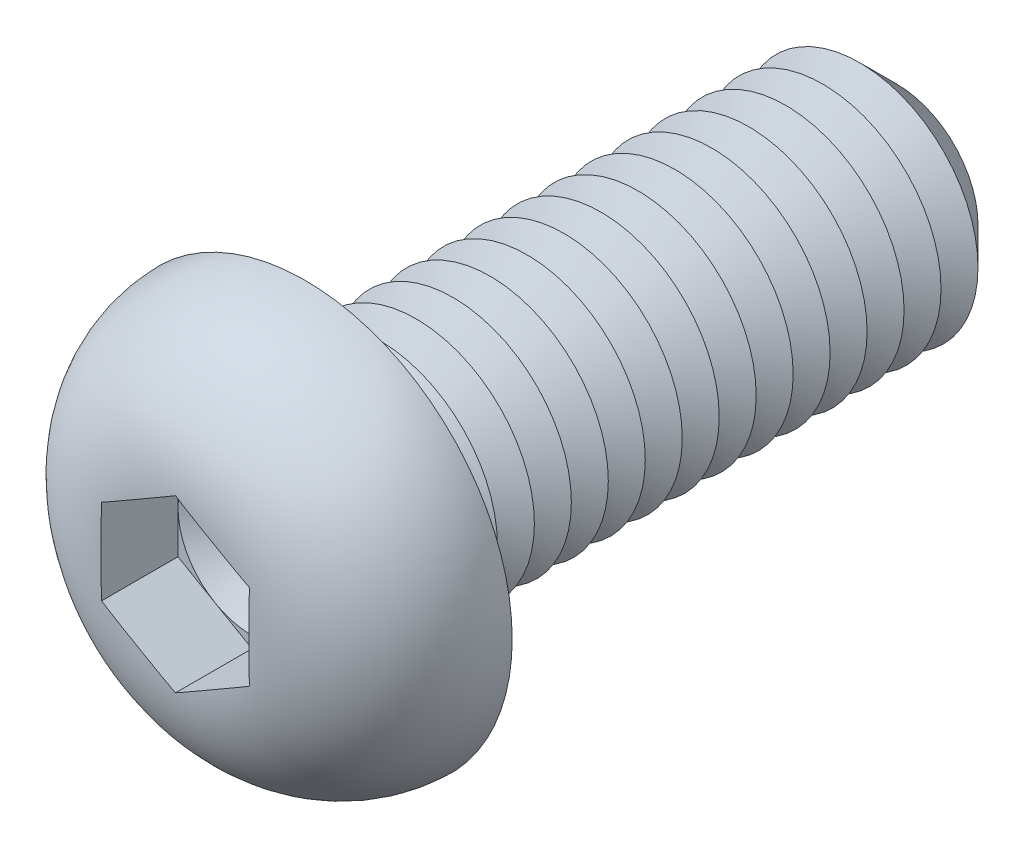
ISO-10303-21;
HEADER;
FILE_DESCRIPTION(('STEP AP214'),'2;1');
FILE_NAME('part.step','',(''),(''),'','','');
FILE_SCHEMA(('AUTOMOTIVE_DESIGN { 1 0 10303 214 1 1 1 1 }'));
ENDSEC;
DATA;
#1=APPLICATION_CONTEXT('core data for automotive mechanical design processes');
#2=APPLICATION_PROTOCOL_DEFINITION('international standard','automotive_design',2000,#1);
#3=PRODUCT_CONTEXT('',#1,'mechanical');
#4=PRODUCT('Part','Part','',(#3));
#5=PRODUCT_RELATED_PRODUCT_CATEGORY('part','',(#4));
#6=PRODUCT_DEFINITION_FORMATION('','',#4);
#7=PRODUCT_DEFINITION_CONTEXT('part definition',#1,'design');
#8=PRODUCT_DEFINITION('design','',#6,#7);
#9=PRODUCT_DEFINITION_SHAPE('','',#8);
#10=(LENGTH_UNIT() NAMED_UNIT(*) SI_UNIT(.MILLI.,.METRE.));
#11=(NAMED_UNIT(*) PLANE_ANGLE_UNIT() SI_UNIT($,.RADIAN.));
#12=(NAMED_UNIT(*) SI_UNIT($,.STERADIAN.) SOLID_ANGLE_UNIT());
#13=UNCERTAINTY_MEASURE_WITH_UNIT(LENGTH_MEASURE(1.E-05),#10,'distance_accuracy_value','');
#14=(GEOMETRIC_REPRESENTATION_CONTEXT(3) GLOBAL_UNCERTAINTY_ASSIGNED_CONTEXT((#13)) GLOBAL_UNIT_ASSIGNED_CONTEXT((#10,
#11,#12)) REPRESENTATION_CONTEXT('',''));
#15=CARTESIAN_POINT('',(0.,0.,0.));
#16=DIRECTION('',(0.,0.,1.));
#17=DIRECTION('',(1.,0.,0.));
#18=AXIS2_PLACEMENT_3D('',#15,#16,#17);
#19=CARTESIAN_POINT('',(0.,0.,1.8));
#20=DIRECTION('',(0.,0.,1.));
#21=DIRECTION('',(1.,0.,0.));
#22=AXIS2_PLACEMENT_3D('',#19,#20,#21);
#23=PLANE('',#22);
#24=CARTESIAN_POINT('',(0.,0.,1.8));
#25=DIRECTION('',(0.,0.,1.));
#26=DIRECTION('',(1.,0.,0.));
#27=AXIS2_PLACEMENT_3D('',#24,#25,#26);
#28=CIRCLE('',#27,2.5);
#29=CARTESIAN_POINT('',(2.5,0.,1.8));
#30=VERTEX_POINT('',#29);
#31=CARTESIAN_POINT('',(1.25,2.1650635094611,1.8));
#32=VERTEX_POINT('',#31);
#33=EDGE_CURVE('E153',#30,#32,#28,.T.);
#34=ORIENTED_EDGE('',*,*,#33,.F.);
#35=DIRECTION('',(0.,1.,0.));
#36=VECTOR('',#35,1.);
#37=CARTESIAN_POINT('',(2.5,-1.44337567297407,1.8));
#38=LINE('',#37,#36);
#39=CARTESIAN_POINT('',(2.5,1.44337567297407,1.8));
#40=VERTEX_POINT('',#39);
#41=EDGE_CURVE('E176',#30,#40,#38,.T.);
#42=ORIENTED_EDGE('',*,*,#41,.T.);
#43=DIRECTION('',(-0.866025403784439,0.5,0.));
#44=VECTOR('',#43,1.);
#45=CARTESIAN_POINT('',(2.5,1.44337567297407,1.8));
#46=LINE('',#45,#44);
#47=EDGE_CURVE('E172',#40,#32,#46,.T.);
#48=ORIENTED_EDGE('',*,*,#47,.T.);
#49=EDGE_LOOP('',(#34,#42,#48));
#50=FACE_BOUND('',#49,.T.);
#51=ADVANCED_FACE('F39',(#50),#23,.T.);
#52=CARTESIAN_POINT('',(0.,0.,1.8));
#53=DIRECTION('',(0.,0.,1.));
#54=DIRECTION('',(1.,0.,0.));
#55=AXIS2_PLACEMENT_3D('',#52,#53,#54);
#56=CIRCLE('',#55,2.5);
#57=CARTESIAN_POINT('',(-1.25,2.1650635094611,1.8));
#58=VERTEX_POINT('',#57);
#59=EDGE_CURVE('E11',#32,#58,#56,.T.);
#60=ORIENTED_EDGE('',*,*,#59,.F.);
#61=CARTESIAN_POINT('',(0.,2.88675134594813,1.8));
#62=VERTEX_POINT('',#61);
#63=EDGE_CURVE('E166',#32,#62,#46,.T.);
#64=ORIENTED_EDGE('',*,*,#63,.T.);
#65=DIRECTION('',(-0.866025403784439,-0.5,0.));
#66=VECTOR('',#65,1.);
#67=CARTESIAN_POINT('',(0.,2.88675134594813,1.8));
#68=LINE('',#67,#66);
#69=EDGE_CURVE('E167',#62,#58,#68,.T.);
#70=ORIENTED_EDGE('',*,*,#69,.T.);
#71=EDGE_LOOP('',(#60,#64,#70));
#72=FACE_BOUND('',#71,.T.);
#73=ADVANCED_FACE('F165',(#72),#23,.T.);
#74=CARTESIAN_POINT('',(-2.5,0.,1.8));
#75=VERTEX_POINT('',#74);
#76=EDGE_CURVE('E49',#58,#75,#56,.T.);
#77=ORIENTED_EDGE('',*,*,#76,.F.);
#78=CARTESIAN_POINT('',(-2.5,1.44337567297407,1.8));
#79=VERTEX_POINT('',#78);
#80=EDGE_CURVE('E179',#58,#79,#68,.T.);
#81=ORIENTED_EDGE('',*,*,#80,.T.);
#82=DIRECTION('',(0.,-1.,0.));
#83=VECTOR('',#82,1.);
#84=CARTESIAN_POINT('',(-2.5,1.44337567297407,1.8));
#85=LINE('',#84,#83);
#86=EDGE_CURVE('E188',#79,#75,#85,.T.);
#87=ORIENTED_EDGE('',*,*,#86,.T.);
#88=EDGE_LOOP('',(#77,#81,#87));
#89=FACE_BOUND('',#88,.T.);
#90=ADVANCED_FACE('F436',(#89),#23,.T.);
#91=CARTESIAN_POINT('',(-1.25,-2.1650635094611,1.8));
#92=VERTEX_POINT('',#91);
#93=EDGE_CURVE('E421',#75,#92,#56,.T.);
#94=ORIENTED_EDGE('',*,*,#93,.F.);
#95=CARTESIAN_POINT('',(-2.5,-1.44337567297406,1.8));
#96=VERTEX_POINT('',#95);
#97=EDGE_CURVE('E187',#75,#96,#85,.T.);
#98=ORIENTED_EDGE('',*,*,#97,.T.);
#99=DIRECTION('',(0.866025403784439,-0.5,0.));
#100=VECTOR('',#99,1.);
#101=CARTESIAN_POINT('',(-2.5,-1.44337567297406,1.8));
#102=LINE('',#101,#100);
#103=EDGE_CURVE('E193',#96,#92,#102,.T.);
#104=ORIENTED_EDGE('',*,*,#103,.T.);
#105=EDGE_LOOP('',(#94,#98,#104));
#106=FACE_BOUND('',#105,.T.);
#107=ADVANCED_FACE('F430',(#106),#23,.T.);
#108=CARTESIAN_POINT('',(1.25,-2.1650635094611,1.8));
#109=VERTEX_POINT('',#108);
#110=EDGE_CURVE('E56',#92,#109,#56,.T.);
#111=ORIENTED_EDGE('',*,*,#110,.F.);
#112=CARTESIAN_POINT('',(0.,-2.88675134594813,1.8));
#113=VERTEX_POINT('',#112);
#114=EDGE_CURVE('E192',#92,#113,#102,.T.);
#115=ORIENTED_EDGE('',*,*,#114,.T.);
#116=DIRECTION('',(0.866025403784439,0.5,0.));
#117=VECTOR('',#116,1.);
#118=CARTESIAN_POINT('',(0.,-2.88675134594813,1.8));
#119=LINE('',#118,#117);
#120=EDGE_CURVE('E198',#113,#109,#119,.T.);
#121=ORIENTED_EDGE('',*,*,#120,.T.);
#122=EDGE_LOOP('',(#111,#115,#121));
#123=FACE_BOUND('',#122,.T.);
#124=ADVANCED_FACE('F471',(#123),#23,.T.);
#125=CARTESIAN_POINT('',(0.,0.,-20.));
#126=DIRECTION('',(0.,0.,1.));
#127=DIRECTION('',(1.,0.,0.));
#128=AXIS2_PLACEMENT_3D('',#125,#126,#127);
#129=CYLINDRICAL_SURFACE('',#128,4.);
#130=CARTESIAN_POINT('',(0.,0.,-0.5));
#131=DIRECTION('',(0.,0.,1.));
#132=DIRECTION('',(1.,0.,0.));
#133=AXIS2_PLACEMENT_3D('',#130,#131,#132);
#134=CIRCLE('',#133,4.);
#135=CARTESIAN_POINT('',(4.,0.,-0.5));
#136=VERTEX_POINT('',#135);
#137=EDGE_CURVE('E409',#136,#136,#134,.F.);
#138=ORIENTED_EDGE('',*,*,#137,.T.);
#139=EDGE_LOOP('',(#138));
#140=FACE_BOUND('',#139,.T.);
#141=CARTESIAN_POINT('',(0.,0.,-1.25));
#142=DIRECTION('',(0.,0.,1.));
#143=DIRECTION('',(1.,0.,0.));
#144=AXIS2_PLACEMENT_3D('',#141,#142,#143);
#145=CIRCLE('',#144,4.00000000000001);
#146=CARTESIAN_POINT('',(4.00000000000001,0.,-1.25));
#147=VERTEX_POINT('',#146);
#148=EDGE_CURVE('E183',#147,#147,#145,.T.);
#149=ORIENTED_EDGE('',*,*,#148,.T.);
#150=EDGE_LOOP('',(#149));
#151=FACE_BOUND('',#150,.T.);
#152=ADVANCED_FACE('F466',(#140,#151),#129,.T.);
#153=CARTESIAN_POINT('',(0.,7.,0.));
#154=DIRECTION('',(0.,0.,1.));
#155=DIRECTION('',(1.,0.,0.));
#156=AXIS2_PLACEMENT_3D('',#153,#154,#155);
#157=PLANE('',#156);
#158=CARTESIAN_POINT('',(0.,0.,0.));
#159=DIRECTION('',(0.,0.,1.));
#160=DIRECTION('',(1.,0.,0.));
#161=AXIS2_PLACEMENT_3D('',#158,#159,#160);
#162=CIRCLE('',#161,4.5);
#163=CARTESIAN_POINT('',(4.5,0.,0.));
#164=VERTEX_POINT('',#163);
#165=EDGE_CURVE('E412',#164,#164,#162,.T.);
#166=ORIENTED_EDGE('',*,*,#165,.T.);
#167=EDGE_LOOP('',(#166));
#168=FACE_BOUND('',#167,.T.);
#169=CARTESIAN_POINT('',(0.,0.,0.));
#170=DIRECTION('',(0.,0.,1.));
#171=DIRECTION('',(1.,0.,0.));
#172=AXIS2_PLACEMENT_3D('',#169,#170,#171);
#173=CIRCLE('',#172,7.);
#174=CARTESIAN_POINT('',(7.,0.,0.));
#175=VERTEX_POINT('',#174);
#176=EDGE_CURVE('E209',#175,#175,#173,.T.);
#177=ORIENTED_EDGE('',*,*,#176,.F.);
#178=EDGE_LOOP('',(#177));
#179=FACE_BOUND('',#178,.T.);
#180=ADVANCED_FACE('F464',(#168,#179),#157,.F.);
#181=CARTESIAN_POINT('',(0.,0.,-0.1));
#182=DIRECTION('',(0.,0.,1.));
#183=DIRECTION('',(1.,0.,0.));
#184=AXIS2_PLACEMENT_3D('',#181,#182,#183);
#185=DEGENERATE_TOROIDAL_SURFACE('',#184,2.5011112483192,4.5,.T.);
#186=CARTESIAN_POINT('',(1.31456088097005,2.12778926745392,4.4));
#187=DIRECTION('',(-0.866025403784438,0.500000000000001,0.));
#188=VECTOR('',#187,1.);
#189=LINE('',#186,#188);
#190=CARTESIAN_POINT('',(1.31456088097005,2.12778926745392,4.4));
#191=VERTEX_POINT('',#190);
#192=CARTESIAN_POINT('',(1.18543911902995,2.20233775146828,4.4));
#193=VERTEX_POINT('',#192);
#194=EDGE_CURVE('E397',#191,#193,#189,.T.);
#195=ORIENTED_EDGE('',*,*,#194,.F.);
#196=CARTESIAN_POINT('',(-0.000200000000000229,2.88686681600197,4.38343536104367));
#197=CARTESIAN_POINT('',(0.103935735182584,2.82674402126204,4.38859262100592));
#198=CARTESIAN_POINT('',(0.208111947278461,2.76659785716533,4.39207570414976));
#199=CARTESIAN_POINT('',(0.416486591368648,2.64629270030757,4.39683754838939));
#200=CARTESIAN_POINT('',(0.520685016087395,2.58613371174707,4.39811670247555));
#201=CARTESIAN_POINT('',(0.729066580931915,2.46582455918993,4.3996156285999));
#202=CARTESIAN_POINT('',(0.833249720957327,2.40567439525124,4.39983556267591));
#203=CARTESIAN_POINT('',(1.04162190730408,2.2853706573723,4.4000276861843));
#204=CARTESIAN_POINT('',(1.14581095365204,2.2252170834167,4.39999986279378));
#205=CARTESIAN_POINT('',(1.35418904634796,2.10490993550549,4.39999986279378));
#206=CARTESIAN_POINT('',(1.45837809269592,2.04475636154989,4.4000276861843));
#207=CARTESIAN_POINT('',(1.66675027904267,1.92445262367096,4.39983556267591));
#208=CARTESIAN_POINT('',(1.77093341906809,1.86430245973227,4.3996156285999));
#209=CARTESIAN_POINT('',(1.97931498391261,1.74399330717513,4.39811670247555));
#210=CARTESIAN_POINT('',(2.08351340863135,1.68383431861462,4.39683754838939));
#211=CARTESIAN_POINT('',(2.29188805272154,1.56352916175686,4.39207570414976));
#212=CARTESIAN_POINT('',(2.39606426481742,1.50338299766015,4.38859262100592));
#213=CARTESIAN_POINT('',(2.5002,1.44326020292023,4.38343536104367));
#214=B_SPLINE_CURVE_WITH_KNOTS('',3,(#196,#197,#198,#199,#200,#201,#202,#203,#204,#205,#206,
#207,#208,#209,#210,#211,#212,#213),.UNSPECIFIED.,.F.,.F.,(4,2,2,2,2,2,2,2,4),(0.,
0.361022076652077,0.721979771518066,1.08288224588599,1.44380339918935,1.80472455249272,
2.16562702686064,2.52658472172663,2.88760679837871),.UNSPECIFIED.);
#215=CARTESIAN_POINT('',(2.5,1.44337567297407,4.38344529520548));
#216=VERTEX_POINT('',#215);
#217=EDGE_CURVE('E353',#191,#216,#214,.T.);
#218=ORIENTED_EDGE('',*,*,#217,.T.);
#219=CARTESIAN_POINT('',(2.5,0.,4.39999986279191));
#220=CARTESIAN_POINT('',(2.5,-0.104697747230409,4.39999811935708));
#221=CARTESIAN_POINT('',(2.5,-0.209395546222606,4.40001551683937));
#222=CARTESIAN_POINT('',(2.5,-0.418792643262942,4.39990807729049));
#223=CARTESIAN_POINT('',(2.5,-0.52349194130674,4.39978323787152));
#224=CARTESIAN_POINT('',(2.5,-0.732936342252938,4.39891238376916));
#225=CARTESIAN_POINT('',(2.5,-0.837681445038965,4.39816609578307));
#226=CARTESIAN_POINT('',(2.5,-1.04715282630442,4.39536239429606));
#227=CARTESIAN_POINT('',(2.5,-1.15187910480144,4.39330498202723));
#228=CARTESIAN_POINT('',(2.5,-1.46476484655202,4.38400647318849));
#229=CARTESIAN_POINT('',(2.5,-1.67286375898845,4.37365196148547));
#230=CARTESIAN_POINT('',(2.5,-2.08783281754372,4.33852954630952));
#231=CARTESIAN_POINT('',(2.5,-2.29470379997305,4.31377296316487));
#232=CARTESIAN_POINT('',(2.5,-2.64451002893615,4.25536510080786));
#233=CARTESIAN_POINT('',(2.5,-2.78823975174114,4.22651785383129));
#234=CARTESIAN_POINT('',(2.5,-3.073224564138,4.15827060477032));
#235=CARTESIAN_POINT('',(2.5,-3.21447933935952,4.11886927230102));
#236=CARTESIAN_POINT('',(2.5,-3.49353952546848,4.02870287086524));
#237=CARTESIAN_POINT('',(2.5,-3.6313402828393,3.97792330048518));
#238=CARTESIAN_POINT('',(2.5,-3.90204977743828,3.86463774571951));
#239=CARTESIAN_POINT('',(2.5,-4.0349587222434,3.8021322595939));
#240=CARTESIAN_POINT('',(2.5,-4.2956525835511,3.66474880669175));
#241=CARTESIAN_POINT('',(2.5,-4.42338586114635,3.58977252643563));
#242=CARTESIAN_POINT('',(2.5,-4.67118559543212,3.42803136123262));
#243=CARTESIAN_POINT('',(2.5,-4.79125159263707,3.3412657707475));
#244=CARTESIAN_POINT('',(2.5,-5.02233156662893,3.15645800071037));
#245=CARTESIAN_POINT('',(2.5,-5.13334771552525,3.05841854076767));
#246=CARTESIAN_POINT('',(2.5,-5.34506083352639,2.85177471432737));
#247=CARTESIAN_POINT('',(2.5,-5.44575933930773,2.74317192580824));
#248=CARTESIAN_POINT('',(2.5,-5.62335564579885,2.53102225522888));
#249=CARTESIAN_POINT('',(2.5,-5.70164721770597,2.42863868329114));
#250=CARTESIAN_POINT('',(2.5,-5.84882394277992,2.21725758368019));
#251=CARTESIAN_POINT('',(2.5,-5.91770588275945,2.10825781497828));
#252=CARTESIAN_POINT('',(2.5,-6.04532926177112,1.88460009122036));
#253=CARTESIAN_POINT('',(2.5,-6.1040794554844,1.76994713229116));
#254=CARTESIAN_POINT('',(2.5,-6.21098181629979,1.53574793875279));
#255=CARTESIAN_POINT('',(2.5,-6.25913021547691,1.41619998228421));
#256=CARTESIAN_POINT('',(2.5,-6.34173830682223,1.18065209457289));
#257=CARTESIAN_POINT('',(2.5,-6.37685491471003,1.06488207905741));
#258=CARTESIAN_POINT('',(2.5,-6.43703913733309,0.830714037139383));
#259=CARTESIAN_POINT('',(2.5,-6.46210319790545,0.712315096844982));
#260=CARTESIAN_POINT('',(2.5,-6.50194044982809,0.473848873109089));
#261=CARTESIAN_POINT('',(2.5,-6.51671856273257,0.353782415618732));
#262=CARTESIAN_POINT('',(2.5,-6.53588982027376,0.112808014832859));
#263=CARTESIAN_POINT('',(2.5,-6.54027911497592,-0.00810022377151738));
#264=CARTESIAN_POINT('',(2.5,-6.53779027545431,-0.365870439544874));
#265=CARTESIAN_POINT('',(2.5,-6.51607942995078,-0.602790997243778));
#266=CARTESIAN_POINT('',(2.5,-6.43310265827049,-1.06957107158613));
#267=CARTESIAN_POINT('',(2.5,-6.3718398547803,-1.29943114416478));
#268=CARTESIAN_POINT('',(2.5,-6.25195024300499,-1.63390601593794));
#269=CARTESIAN_POINT('',(2.5,-6.20730237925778,-1.74371189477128));
#270=CARTESIAN_POINT('',(2.5,-6.10902350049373,-1.95921136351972));
#271=CARTESIAN_POINT('',(2.5,-6.05539567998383,-2.06490639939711));
#272=CARTESIAN_POINT('',(2.5,-5.93955620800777,-2.27152527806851));
#273=CARTESIAN_POINT('',(2.5,-5.87734126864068,-2.37244727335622));
#274=CARTESIAN_POINT('',(2.5,-5.7448545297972,-2.56880727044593));
#275=CARTESIAN_POINT('',(2.5,-5.67458537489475,-2.6642470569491));
#276=CARTESIAN_POINT('',(2.5,-5.52523018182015,-2.85070592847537));
#277=CARTESIAN_POINT('',(2.5,-5.44601185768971,-2.94161901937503));
#278=CARTESIAN_POINT('',(2.5,-5.28044044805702,-3.11663859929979));
#279=CARTESIAN_POINT('',(2.5,-5.194089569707,-3.2007471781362));
#280=CARTESIAN_POINT('',(2.5,-5.01485870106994,-3.36178408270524));
#281=CARTESIAN_POINT('',(2.5,-4.92197538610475,-3.43870870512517));
#282=CARTESIAN_POINT('',(2.5,-4.73045535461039,-3.58495812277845));
#283=CARTESIAN_POINT('',(2.5,-4.6318202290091,-3.65428500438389));
#284=CARTESIAN_POINT('',(2.5,-4.4247626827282,-3.78818551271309));
#285=CARTESIAN_POINT('',(2.5,-4.31609824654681,-3.85238474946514));
#286=CARTESIAN_POINT('',(2.5,-4.0940582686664,-3.97208975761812));
#287=CARTESIAN_POINT('',(2.5,-3.98068153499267,-4.02759331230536));
#288=CARTESIAN_POINT('',(2.5,-3.75029026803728,-4.12981004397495));
#289=CARTESIAN_POINT('',(2.5,-3.63328275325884,-4.17653908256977));
#290=CARTESIAN_POINT('',(2.5,-3.39631992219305,-4.2614893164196));
#291=CARTESIAN_POINT('',(2.5,-3.27636651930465,-4.29971587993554));
#292=CARTESIAN_POINT('',(2.5,-3.00446622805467,-4.37644925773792));
#293=CARTESIAN_POINT('',(2.5,-2.85188931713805,-4.41272455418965));
#294=CARTESIAN_POINT('',(2.5,-2.54443794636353,-4.47385449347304));
#295=CARTESIAN_POINT('',(2.5,-2.3895624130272,-4.49870361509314));
#296=CARTESIAN_POINT('',(2.5,-2.07807451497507,-4.53870829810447));
#297=CARTESIAN_POINT('',(2.5,-1.92145805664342,-4.55383091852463));
#298=CARTESIAN_POINT('',(2.5,-1.60772330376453,-4.57647936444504));
#299=CARTESIAN_POINT('',(2.5,-1.45060502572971,-4.58400543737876));
#300=CARTESIAN_POINT('',(2.5,-1.13432460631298,-4.59416656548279));
#301=CARTESIAN_POINT('',(2.5,-0.975160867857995,-4.59674096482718));
#302=CARTESIAN_POINT('',(2.5,-0.656826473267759,-4.59957813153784));
#303=CARTESIAN_POINT('',(2.5,-0.497655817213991,-4.59984092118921));
#304=CARTESIAN_POINT('',(2.5,-0.179547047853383,-4.60005428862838));
#305=CARTESIAN_POINT('',(2.5,-0.02060893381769,-4.60000532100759));
#306=CARTESIAN_POINT('',(2.5,0.297265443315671,-4.59999304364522));
#307=CARTESIAN_POINT('',(2.5,0.456201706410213,-4.60002973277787));
#308=CARTESIAN_POINT('',(2.5,0.70967559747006,-4.59902611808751));
#309=CARTESIAN_POINT('',(2.5,0.804213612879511,-4.59841616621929));
#310=CARTESIAN_POINT('',(2.5,0.99327694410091,-4.59620676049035));
#311=CARTESIAN_POINT('',(2.5,1.08780225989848,-4.59460730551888));
#312=CARTESIAN_POINT('',(2.5,1.37137837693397,-4.58746770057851));
#313=CARTESIAN_POINT('',(2.5,1.56039301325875,-4.57958602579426));
#314=CARTESIAN_POINT('',(2.5,1.93609462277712,-4.55305686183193));
#315=CARTESIAN_POINT('',(2.5,2.12278756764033,-4.53450331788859));
#316=CARTESIAN_POINT('',(2.5,2.49421016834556,-4.48296248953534));
#317=CARTESIAN_POINT('',(2.5,2.67894050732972,-4.44998040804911));
#318=CARTESIAN_POINT('',(2.5,2.99962701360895,-4.37718406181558));
#319=CARTESIAN_POINT('',(2.5,3.13641465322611,-4.34103978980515));
#320=CARTESIAN_POINT('',(2.5,3.40682838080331,-4.25834226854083));
#321=CARTESIAN_POINT('',(2.5,3.54045461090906,-4.21178948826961));
#322=CARTESIAN_POINT('',(2.5,3.80387940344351,-4.1076796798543));
#323=CARTESIAN_POINT('',(2.5,3.93366385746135,-4.05008679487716));
#324=CARTESIAN_POINT('',(2.5,4.18776789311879,-3.92385886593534));
#325=CARTESIAN_POINT('',(2.5,4.31208736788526,-3.85522360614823));
#326=CARTESIAN_POINT('',(2.5,4.55475418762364,-3.70660227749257));
#327=CARTESIAN_POINT('',(2.5,4.67306276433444,-3.62655275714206));
#328=CARTESIAN_POINT('',(2.5,4.90171316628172,-3.45576294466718));
#329=CARTESIAN_POINT('',(2.5,5.01205476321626,-3.36502234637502));
#330=CARTESIAN_POINT('',(2.5,5.22347091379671,-3.17353376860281));
#331=CARTESIAN_POINT('',(2.5,5.32455555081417,-3.07279693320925));
#332=CARTESIAN_POINT('',(2.5,5.51647993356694,-2.86200023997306));
#333=CARTESIAN_POINT('',(2.5,5.6073208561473,-2.75194145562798));
#334=CARTESIAN_POINT('',(2.5,5.76832451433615,-2.53607083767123));
#335=CARTESIAN_POINT('',(2.5,5.83966300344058,-2.4311337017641));
#336=CARTESIAN_POINT('',(2.5,5.97282702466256,-2.2153291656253));
#337=CARTESIAN_POINT('',(2.5,6.03464926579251,-2.10445973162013));
#338=CARTESIAN_POINT('',(2.5,6.14815657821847,-1.87771731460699));
#339=CARTESIAN_POINT('',(2.5,6.19984675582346,-1.76184688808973));
#340=CARTESIAN_POINT('',(2.5,6.29267395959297,-1.52590109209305));
#341=CARTESIAN_POINT('',(2.5,6.33380720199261,-1.40582423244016));
#342=CARTESIAN_POINT('',(2.5,6.40328888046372,-1.16869740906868));
#343=CARTESIAN_POINT('',(2.5,6.43218419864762,-1.05180738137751));
#344=CARTESIAN_POINT('',(2.5,6.47988151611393,-0.815941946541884));
#345=CARTESIAN_POINT('',(2.5,6.49867991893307,-0.696965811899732));
#346=CARTESIAN_POINT('',(2.5,6.52599950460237,-0.457898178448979));
#347=CARTESIAN_POINT('',(2.5,6.53452634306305,-0.337807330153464));
#348=CARTESIAN_POINT('',(2.5,6.54126106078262,-0.0973214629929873));
#349=CARTESIAN_POINT('',(2.5,6.5394651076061,0.023073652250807));
#350=CARTESIAN_POINT('',(2.5,6.51879545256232,0.379398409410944));
#351=CARTESIAN_POINT('',(2.5,6.48510560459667,0.614630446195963));
#352=CARTESIAN_POINT('',(2.5,6.37872360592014,1.07608887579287));
#353=CARTESIAN_POINT('',(2.5,6.30603128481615,1.3023152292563));
#354=CARTESIAN_POINT('',(2.5,6.16957161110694,1.63028303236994));
#355=CARTESIAN_POINT('',(2.5,6.11941470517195,1.7378698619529));
#356=CARTESIAN_POINT('',(2.5,6.01034124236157,1.94849153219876));
#357=CARTESIAN_POINT('',(2.5,5.9514277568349,2.05152795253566));
#358=CARTESIAN_POINT('',(2.5,5.82528890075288,2.25240256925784));
#359=CARTESIAN_POINT('',(2.5,5.75806159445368,2.35023954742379));
#360=CARTESIAN_POINT('',(2.5,5.61585543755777,2.54005689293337));
#361=CARTESIAN_POINT('',(2.5,5.54087908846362,2.63203913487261));
#362=CARTESIAN_POINT('',(2.5,5.38212190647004,2.81146438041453));
#363=CARTESIAN_POINT('',(2.5,5.29819182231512,2.89877528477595));
#364=CARTESIAN_POINT('',(2.5,5.12353712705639,3.06625194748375));
#365=CARTESIAN_POINT('',(2.5,5.03281455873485,3.14641983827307));
#366=CARTESIAN_POINT('',(2.5,4.84518171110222,3.29930665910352));
#367=CARTESIAN_POINT('',(2.5,4.74826657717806,3.37201962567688));
#368=CARTESIAN_POINT('',(2.5,4.54907485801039,3.50961479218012));
#369=CARTESIAN_POINT('',(2.5,4.44679969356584,3.57449905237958));
#370=CARTESIAN_POINT('',(2.5,4.23202545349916,3.69953578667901));
#371=CARTESIAN_POINT('',(2.5,4.11927203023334,3.75925114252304));
#372=CARTESIAN_POINT('',(2.5,3.88947986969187,3.86977617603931));
#373=CARTESIAN_POINT('',(2.5,3.77244067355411,3.92058489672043));
#374=CARTESIAN_POINT('',(2.5,3.5351804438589,4.0133148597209));
#375=CARTESIAN_POINT('',(2.5,3.41496637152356,4.0552539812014));
#376=CARTESIAN_POINT('',(2.5,3.17195278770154,4.13067246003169));
#377=CARTESIAN_POINT('',(2.5,3.04915378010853,4.16415344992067));
#378=CARTESIAN_POINT('',(2.5,2.80683027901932,4.22194717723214));
#379=CARTESIAN_POINT('',(2.5,2.68738216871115,4.2465834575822));
#380=CARTESIAN_POINT('',(2.5,2.44729214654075,4.28920746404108));
#381=CARTESIAN_POINT('',(2.5,2.32664997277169,4.30719369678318));
#382=CARTESIAN_POINT('',(2.5,2.08450864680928,4.33736171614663));
#383=CARTESIAN_POINT('',(2.5,1.9630086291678,4.3495363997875));
#384=CARTESIAN_POINT('',(2.5,1.71961501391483,4.36908103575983));
#385=CARTESIAN_POINT('',(2.5,1.59772134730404,4.37645009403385));
#386=CARTESIAN_POINT('',(2.5,1.35283283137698,4.38761579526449));
#387=CARTESIAN_POINT('',(2.5,1.22983679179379,4.39138420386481));
#388=CARTESIAN_POINT('',(2.5,0.983808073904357,4.3965493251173));
#389=CARTESIAN_POINT('',(2.5,0.860775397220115,4.3979461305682));
#390=CARTESIAN_POINT('',(2.5,0.614783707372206,4.39958107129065));
#391=CARTESIAN_POINT('',(2.5,0.491824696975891,4.3998199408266));
#392=CARTESIAN_POINT('',(2.5,0.245910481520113,4.40003035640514));
#393=CARTESIAN_POINT('',(2.5,0.122955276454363,4.4000019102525));
#394=CARTESIAN_POINT('',(2.5,0.,4.39999986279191));
#395=B_SPLINE_CURVE_WITH_KNOTS('',3,(#219,#220,#221,#222,#223,#224,#225,#226,#227,#228,#229,
#230,#231,#232,#233,#234,#235,#236,#237,#238,#239,#240,#241,#242,#243,#244,#245,#246,#247,#248,
#249,#250,#251,#252,#253,#254,#255,#256,#257,#258,#259,#260,#261,#262,#263,#264,#265,#266,#267,
#268,#269,#270,#271,#272,#273,#274,#275,#276,#277,#278,#279,#280,#281,#282,#283,#284,#285,#286,
#287,#288,#289,#290,#291,#292,#293,#294,#295,#296,#297,#298,#299,#300,#301,#302,#303,#304,#305,
#306,#307,#308,#309,#310,#311,#312,#313,#314,#315,#316,#317,#318,#319,#320,#321,#322,#323,#324,
#325,#326,#327,#328,#329,#330,#331,#332,#333,#334,#335,#336,#337,#338,#339,#340,#341,#342,#343,
#344,#345,#346,#347,#348,#349,#350,#351,#352,#353,#354,#355,#356,#357,#358,#359,#360,#361,#362,
#363,#364,#365,#366,#367,#368,#369,#370,#371,#372,#373,#374,#375,#376,#377,#378,#379,#380,#381,
#382,#383,#384,#385,#386,#387,#388,#389,#390,#391,#392,#393,#394),.UNSPECIFIED.,.T.,.F.,(4,2,2,
2,2,2,2,2,2,2,2,2,2,2,2,2,2,2,2,2,2,2,2,2,2,2,2,2,2,2,2,2,2,2,2,2,2,2,2,2,2,2,2,2,2,2,2,2,2,2,2,
2,2,2,2,2,2,2,2,2,2,2,2,2,2,2,2,2,2,2,2,2,2,2,2,2,2,2,2,2,2,2,2,2,2,2,2,4),(0.,
0.314093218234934,0.62819170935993,0.942428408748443,1.25666481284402,1.88144147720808,
2.50572771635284,2.94516878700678,3.38466527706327,3.82472511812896,4.26476626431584,
4.70845695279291,5.15217420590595,5.59578464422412,6.03932891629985,6.42549664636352,
6.81179591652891,7.19775970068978,7.58386043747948,7.94635637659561,8.30898036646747,
8.67143073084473,9.03401539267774,9.74414367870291,10.4542159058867,10.8094792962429,
11.1646165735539,11.5198902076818,11.8750475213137,12.2363927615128,12.597626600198,
12.9590456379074,13.3203651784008,13.698597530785,14.0769261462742,14.4545641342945,
14.8319630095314,15.3019396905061,15.7721432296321,16.2439309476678,16.715703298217,
17.1932187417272,17.6707295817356,18.1475442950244,18.6243527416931,18.9079682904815,
19.1915841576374,19.7589248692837,20.3213460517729,20.8835645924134,21.3076400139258,
21.731696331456,22.1571540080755,22.5826200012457,23.0105507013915,23.4384936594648,
23.8659647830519,24.2933867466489,24.6735755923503,25.0538956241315,25.4340234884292,
25.8142874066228,26.1750761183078,26.5359932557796,26.8967115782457,27.2575638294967,
27.9668653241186,28.6761699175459,29.0319382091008,29.3875820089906,29.7433087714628,
30.0989210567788,30.4618400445,30.8246503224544,31.1877485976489,31.5507511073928,
31.9331198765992,32.3155297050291,32.6971611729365,33.0787189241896,33.4443988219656,
33.8101607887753,34.1763686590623,34.54264464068,34.9117697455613,35.2808804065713,
35.6497569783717,36.0186227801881),.UNSPECIFIED.);
#396=CARTESIAN_POINT('',(2.5,0.0745484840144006,4.4));
#397=VERTEX_POINT('',#396);
#398=EDGE_CURVE('E343',#216,#397,#395,.T.);
#399=ORIENTED_EDGE('',*,*,#398,.T.);
#400=CARTESIAN_POINT('',(2.5,-0.0745484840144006,4.4));
#401=DIRECTION('',(0.,1.,0.));
#402=VECTOR('',#401,1.);
#403=LINE('',#400,#402);
#404=CARTESIAN_POINT('',(2.5,-0.0745484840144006,4.4));
#405=VERTEX_POINT('',#404);
#406=EDGE_CURVE('E174',#405,#397,#403,.T.);
#407=ORIENTED_EDGE('',*,*,#406,.F.);
#408=CARTESIAN_POINT('',(2.5,-1.44337567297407,4.38344529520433));
#409=VERTEX_POINT('',#408);
#410=EDGE_CURVE('E354',#405,#409,#395,.T.);
#411=ORIENTED_EDGE('',*,*,#410,.T.);
#412=CARTESIAN_POINT('',(2.5002,-1.44326020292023,4.38343536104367));
#413=CARTESIAN_POINT('',(2.39606426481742,-1.50338299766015,4.38859262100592));
#414=CARTESIAN_POINT('',(2.29188805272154,-1.56352916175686,4.39207570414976));
#415=CARTESIAN_POINT('',(2.08351340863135,-1.68383431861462,4.39683754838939));
#416=CARTESIAN_POINT('',(1.9793149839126,-1.74399330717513,4.39811670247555));
#417=CARTESIAN_POINT('',(1.77093341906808,-1.86430245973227,4.3996156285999));
#418=CARTESIAN_POINT('',(1.66675027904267,-1.92445262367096,4.39983556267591));
#419=CARTESIAN_POINT('',(1.45837809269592,-2.04475636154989,4.4000276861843));
#420=CARTESIAN_POINT('',(1.35418904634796,-2.10490993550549,4.39999986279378));
#421=CARTESIAN_POINT('',(1.14581095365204,-2.2252170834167,4.39999986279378));
#422=CARTESIAN_POINT('',(1.04162190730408,-2.2853706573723,4.4000276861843));
#423=CARTESIAN_POINT('',(0.833249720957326,-2.40567439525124,4.39983556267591));
#424=CARTESIAN_POINT('',(0.729066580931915,-2.46582455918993,4.3996156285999));
#425=CARTESIAN_POINT('',(0.520685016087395,-2.58613371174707,4.39811670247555));
#426=CARTESIAN_POINT('',(0.416486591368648,-2.64629270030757,4.39683754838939));
#427=CARTESIAN_POINT('',(0.208111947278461,-2.76659785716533,4.39207570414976));
#428=CARTESIAN_POINT('',(0.103935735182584,-2.82674402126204,4.38859262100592));
#429=CARTESIAN_POINT('',(-0.000200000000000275,-2.88686681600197,4.38343536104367));
#430=B_SPLINE_CURVE_WITH_KNOTS('',3,(#412,#413,#414,#415,#416,#417,#418,#419,#420,#421,#422,
#423,#424,#425,#426,#427,#428,#429),.UNSPECIFIED.,.F.,.F.,(4,2,2,2,2,2,2,2,4),(0.,
0.361022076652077,0.721979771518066,1.08288224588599,1.44380339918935,1.80472455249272,
2.16562702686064,2.52658472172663,2.88760679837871),.UNSPECIFIED.);
#431=CARTESIAN_POINT('',(1.31456088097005,-2.12778926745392,4.4));
#432=VERTEX_POINT('',#431);
#433=EDGE_CURVE('E330',#409,#432,#430,.T.);
#434=ORIENTED_EDGE('',*,*,#433,.T.);
#435=CARTESIAN_POINT('',(1.18543911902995,-2.20233775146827,4.4));
#436=DIRECTION('',(0.866025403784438,0.500000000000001,0.));
#437=VECTOR('',#436,1.);
#438=LINE('',#435,#437);
#439=CARTESIAN_POINT('',(1.18543911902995,-2.20233775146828,4.4));
#440=VERTEX_POINT('',#439);
#441=EDGE_CURVE('E339',#440,#432,#438,.T.);
#442=ORIENTED_EDGE('',*,*,#441,.F.);
#443=CARTESIAN_POINT('',(0.,-2.88675134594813,4.38344529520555));
#444=VERTEX_POINT('',#443);
#445=EDGE_CURVE('E293',#440,#444,#430,.T.);
#446=ORIENTED_EDGE('',*,*,#445,.T.);
#447=CARTESIAN_POINT('',(0.00019999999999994,-2.88686681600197,4.38343536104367));
#448=CARTESIAN_POINT('',(-0.103935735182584,-2.82674402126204,4.38859262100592));
#449=CARTESIAN_POINT('',(-0.208111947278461,-2.76659785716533,4.39207570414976));
#450=CARTESIAN_POINT('',(-0.416486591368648,-2.64629270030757,4.39683754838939));
#451=CARTESIAN_POINT('',(-0.520685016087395,-2.58613371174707,4.39811670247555));
#452=CARTESIAN_POINT('',(-0.729066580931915,-2.46582455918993,4.3996156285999));
#453=CARTESIAN_POINT('',(-0.833249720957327,-2.40567439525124,4.39983556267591));
#454=CARTESIAN_POINT('',(-1.04162190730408,-2.2853706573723,4.4000276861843));
#455=CARTESIAN_POINT('',(-1.14581095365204,-2.2252170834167,4.39999986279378));
#456=CARTESIAN_POINT('',(-1.35418904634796,-2.10490993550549,4.39999986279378));
#457=CARTESIAN_POINT('',(-1.45837809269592,-2.04475636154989,4.4000276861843));
#458=CARTESIAN_POINT('',(-1.66675027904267,-1.92445262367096,4.39983556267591));
#459=CARTESIAN_POINT('',(-1.77093341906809,-1.86430245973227,4.3996156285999));
#460=CARTESIAN_POINT('',(-1.97931498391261,-1.74399330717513,4.39811670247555));
#461=CARTESIAN_POINT('',(-2.08351340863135,-1.68383431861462,4.39683754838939));
#462=CARTESIAN_POINT('',(-2.29188805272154,-1.56352916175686,4.39207570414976));
#463=CARTESIAN_POINT('',(-2.39606426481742,-1.50338299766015,4.38859262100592));
#464=CARTESIAN_POINT('',(-2.5002,-1.44326020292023,4.38343536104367));
#465=B_SPLINE_CURVE_WITH_KNOTS('',3,(#447,#448,#449,#450,#451,#452,#453,#454,#455,#456,#457,
#458,#459,#460,#461,#462,#463,#464),.UNSPECIFIED.,.F.,.F.,(4,2,2,2,2,2,2,2,4),(0.,
0.361022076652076,0.721979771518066,1.08288224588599,1.44380339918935,1.80472455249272,
2.16562702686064,2.52658472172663,2.88760679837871),.UNSPECIFIED.);
#466=CARTESIAN_POINT('',(-1.18543911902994,-2.20233775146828,4.4));
#467=VERTEX_POINT('',#466);
#468=EDGE_CURVE('E283',#444,#467,#465,.T.);
#469=ORIENTED_EDGE('',*,*,#468,.T.);
#470=CARTESIAN_POINT('',(-1.31456088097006,-2.12778926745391,4.4));
#471=DIRECTION('',(0.86602540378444,-0.499999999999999,0.));
#472=VECTOR('',#471,1.);
#473=LINE('',#470,#472);
#474=CARTESIAN_POINT('',(-1.31456088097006,-2.12778926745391,4.4));
#475=VERTEX_POINT('',#474);
#476=EDGE_CURVE('E516',#475,#467,#473,.T.);
#477=ORIENTED_EDGE('',*,*,#476,.F.);
#478=CARTESIAN_POINT('',(-2.5,-1.44337567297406,4.38344529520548));
#479=VERTEX_POINT('',#478);
#480=EDGE_CURVE('E294',#475,#479,#465,.T.);
#481=ORIENTED_EDGE('',*,*,#480,.T.);
#482=CARTESIAN_POINT('',(-2.5,0.,4.39999986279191));
#483=CARTESIAN_POINT('',(-2.5,0.104697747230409,4.39999811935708));
#484=CARTESIAN_POINT('',(-2.5,0.209395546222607,4.40001551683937));
#485=CARTESIAN_POINT('',(-2.5,0.418792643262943,4.39990807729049));
#486=CARTESIAN_POINT('',(-2.5,0.523491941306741,4.39978323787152));
#487=CARTESIAN_POINT('',(-2.5,0.732936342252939,4.39891238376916));
#488=CARTESIAN_POINT('',(-2.5,0.837681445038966,4.39816609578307));
#489=CARTESIAN_POINT('',(-2.5,1.04715282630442,4.39536239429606));
#490=CARTESIAN_POINT('',(-2.5,1.15187910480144,4.39330498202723));
#491=CARTESIAN_POINT('',(-2.5,1.46476484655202,4.38400647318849));
#492=CARTESIAN_POINT('',(-2.5,1.67286375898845,4.37365196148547));
#493=CARTESIAN_POINT('',(-2.5,2.08783281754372,4.33852954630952));
#494=CARTESIAN_POINT('',(-2.5,2.29470379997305,4.31377296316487));
#495=CARTESIAN_POINT('',(-2.5,2.64451002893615,4.25536510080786));
#496=CARTESIAN_POINT('',(-2.5,2.78823975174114,4.22651785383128));
#497=CARTESIAN_POINT('',(-2.5,3.073224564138,4.15827060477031));
#498=CARTESIAN_POINT('',(-2.5,3.21447933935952,4.11886927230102));
#499=CARTESIAN_POINT('',(-2.5,3.49353952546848,4.02870287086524));
#500=CARTESIAN_POINT('',(-2.5,3.6313402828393,3.97792330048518));
#501=CARTESIAN_POINT('',(-2.5,3.90204977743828,3.8646377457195));
#502=CARTESIAN_POINT('',(-2.5,4.0349587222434,3.8021322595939));
#503=CARTESIAN_POINT('',(-2.5,4.2956525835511,3.66474880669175));
#504=CARTESIAN_POINT('',(-2.5,4.42338586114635,3.58977252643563));
#505=CARTESIAN_POINT('',(-2.5,4.67118559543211,3.42803136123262));
#506=CARTESIAN_POINT('',(-2.5,4.79125159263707,3.3412657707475));
#507=CARTESIAN_POINT('',(-2.5,5.02233156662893,3.15645800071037));
#508=CARTESIAN_POINT('',(-2.5,5.13334771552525,3.05841854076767));
#509=CARTESIAN_POINT('',(-2.5,5.34506083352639,2.85177471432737));
#510=CARTESIAN_POINT('',(-2.5,5.44575933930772,2.74317192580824));
#511=CARTESIAN_POINT('',(-2.5,5.62335564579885,2.53102225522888));
#512=CARTESIAN_POINT('',(-2.5,5.70164721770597,2.42863868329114));
#513=CARTESIAN_POINT('',(-2.5,5.84882394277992,2.21725758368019));
#514=CARTESIAN_POINT('',(-2.5,5.91770588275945,2.10825781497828));
#515=CARTESIAN_POINT('',(-2.5,6.04532926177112,1.88460009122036));
#516=CARTESIAN_POINT('',(-2.5,6.1040794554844,1.76994713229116));
#517=CARTESIAN_POINT('',(-2.5,6.21098181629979,1.53574793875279));
#518=CARTESIAN_POINT('',(-2.5,6.25913021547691,1.41619998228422));
#519=CARTESIAN_POINT('',(-2.5,6.34173830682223,1.18065209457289));
#520=CARTESIAN_POINT('',(-2.5,6.37685491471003,1.06488207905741));
#521=CARTESIAN_POINT('',(-2.5,6.43703913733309,0.830714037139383));
#522=CARTESIAN_POINT('',(-2.5,6.46210319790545,0.712315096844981));
#523=CARTESIAN_POINT('',(-2.5,6.50194044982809,0.473848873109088));
#524=CARTESIAN_POINT('',(-2.5,6.51671856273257,0.35378241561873));
#525=CARTESIAN_POINT('',(-2.5,6.53588982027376,0.112808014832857));
#526=CARTESIAN_POINT('',(-2.5,6.54027911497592,-0.00810022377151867));
#527=CARTESIAN_POINT('',(-2.5,6.53779027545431,-0.365870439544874));
#528=CARTESIAN_POINT('',(-2.5,6.51607942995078,-0.602790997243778));
#529=CARTESIAN_POINT('',(-2.5,6.43310265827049,-1.06957107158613));
#530=CARTESIAN_POINT('',(-2.5,6.3718398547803,-1.29943114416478));
#531=CARTESIAN_POINT('',(-2.5,6.25195024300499,-1.63390601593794));
#532=CARTESIAN_POINT('',(-2.5,6.20730237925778,-1.74371189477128));
#533=CARTESIAN_POINT('',(-2.5,6.10902350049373,-1.95921136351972));
#534=CARTESIAN_POINT('',(-2.5,6.05539567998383,-2.06490639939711));
#535=CARTESIAN_POINT('',(-2.5,5.93955620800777,-2.27152527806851));
#536=CARTESIAN_POINT('',(-2.5,5.87734126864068,-2.37244727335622));
#537=CARTESIAN_POINT('',(-2.5,5.7448545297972,-2.56880727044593));
#538=CARTESIAN_POINT('',(-2.5,5.67458537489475,-2.6642470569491));
#539=CARTESIAN_POINT('',(-2.5,5.52523018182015,-2.85070592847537));
#540=CARTESIAN_POINT('',(-2.5,5.44601185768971,-2.94161901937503));
#541=CARTESIAN_POINT('',(-2.5,5.28044044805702,-3.11663859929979));
#542=CARTESIAN_POINT('',(-2.5,5.194089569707,-3.2007471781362));
#543=CARTESIAN_POINT('',(-2.5,5.01485870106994,-3.36178408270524));
#544=CARTESIAN_POINT('',(-2.5,4.92197538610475,-3.43870870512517));
#545=CARTESIAN_POINT('',(-2.5,4.73045535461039,-3.58495812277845));
#546=CARTESIAN_POINT('',(-2.5,4.6318202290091,-3.65428500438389));
#547=CARTESIAN_POINT('',(-2.5,4.4247626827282,-3.78818551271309));
#548=CARTESIAN_POINT('',(-2.5,4.31609824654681,-3.85238474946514));
#549=CARTESIAN_POINT('',(-2.5,4.0940582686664,-3.97208975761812));
#550=CARTESIAN_POINT('',(-2.5,3.98068153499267,-4.02759331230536));
#551=CARTESIAN_POINT('',(-2.5,3.75029026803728,-4.12981004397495));
#552=CARTESIAN_POINT('',(-2.5,3.63328275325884,-4.17653908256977));
#553=CARTESIAN_POINT('',(-2.5,3.39631992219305,-4.2614893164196));
#554=CARTESIAN_POINT('',(-2.5,3.27636651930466,-4.29971587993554));
#555=CARTESIAN_POINT('',(-2.5,3.00446622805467,-4.37644925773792));
#556=CARTESIAN_POINT('',(-2.5,2.85188931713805,-4.41272455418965));
#557=CARTESIAN_POINT('',(-2.5,2.54443794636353,-4.47385449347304));
#558=CARTESIAN_POINT('',(-2.5,2.3895624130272,-4.49870361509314));
#559=CARTESIAN_POINT('',(-2.5,2.07807451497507,-4.53870829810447));
#560=CARTESIAN_POINT('',(-2.5,1.92145805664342,-4.55383091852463));
#561=CARTESIAN_POINT('',(-2.5,1.60772330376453,-4.57647936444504));
#562=CARTESIAN_POINT('',(-2.5,1.45060502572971,-4.58400543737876));
#563=CARTESIAN_POINT('',(-2.5,1.13432460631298,-4.59416656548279));
#564=CARTESIAN_POINT('',(-2.5,0.975160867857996,-4.59674096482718));
#565=CARTESIAN_POINT('',(-2.5,0.65682647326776,-4.59957813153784));
#566=CARTESIAN_POINT('',(-2.5,0.497655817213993,-4.59984092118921));
#567=CARTESIAN_POINT('',(-2.5,0.179547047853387,-4.60005428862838));
#568=CARTESIAN_POINT('',(-2.5,0.0206089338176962,-4.60000532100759));
#569=CARTESIAN_POINT('',(-2.5,-0.297265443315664,-4.59999304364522));
#570=CARTESIAN_POINT('',(-2.5,-0.456201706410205,-4.60002973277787));
#571=CARTESIAN_POINT('',(-2.5,-0.709675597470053,-4.59902611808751));
#572=CARTESIAN_POINT('',(-2.5,-0.804213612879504,-4.59841616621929));
#573=CARTESIAN_POINT('',(-2.5,-0.993276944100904,-4.59620676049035));
#574=CARTESIAN_POINT('',(-2.5,-1.08780225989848,-4.59460730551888));
#575=CARTESIAN_POINT('',(-2.5,-1.37137837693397,-4.58746770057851));
#576=CARTESIAN_POINT('',(-2.5,-1.56039301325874,-4.57958602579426));
#577=CARTESIAN_POINT('',(-2.5,-1.93609462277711,-4.55305686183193));
#578=CARTESIAN_POINT('',(-2.5,-2.12278756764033,-4.53450331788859));
#579=CARTESIAN_POINT('',(-2.5,-2.49421016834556,-4.48296248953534));
#580=CARTESIAN_POINT('',(-2.5,-2.67894050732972,-4.44998040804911));
#581=CARTESIAN_POINT('',(-2.5,-2.99962701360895,-4.37718406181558));
#582=CARTESIAN_POINT('',(-2.5,-3.13641465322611,-4.34103978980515));
#583=CARTESIAN_POINT('',(-2.5,-3.40682838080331,-4.25834226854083));
#584=CARTESIAN_POINT('',(-2.5,-3.54045461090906,-4.21178948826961));
#585=CARTESIAN_POINT('',(-2.5,-3.8038794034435,-4.1076796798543));
#586=CARTESIAN_POINT('',(-2.5,-3.93366385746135,-4.05008679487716));
#587=CARTESIAN_POINT('',(-2.5,-4.18776789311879,-3.92385886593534));
#588=CARTESIAN_POINT('',(-2.5,-4.31208736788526,-3.85522360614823));
#589=CARTESIAN_POINT('',(-2.5,-4.55475418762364,-3.70660227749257));
#590=CARTESIAN_POINT('',(-2.5,-4.67306276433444,-3.62655275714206));
#591=CARTESIAN_POINT('',(-2.5,-4.90171316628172,-3.45576294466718));
#592=CARTESIAN_POINT('',(-2.5,-5.01205476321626,-3.36502234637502));
#593=CARTESIAN_POINT('',(-2.5,-5.2234709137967,-3.17353376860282));
#594=CARTESIAN_POINT('',(-2.5,-5.32455555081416,-3.07279693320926));
#595=CARTESIAN_POINT('',(-2.5,-5.51647993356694,-2.86200023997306));
#596=CARTESIAN_POINT('',(-2.5,-5.6073208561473,-2.75194145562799));
#597=CARTESIAN_POINT('',(-2.5,-5.76832451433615,-2.53607083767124));
#598=CARTESIAN_POINT('',(-2.5,-5.83966300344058,-2.4311337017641));
#599=CARTESIAN_POINT('',(-2.5,-5.97282702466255,-2.2153291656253));
#600=CARTESIAN_POINT('',(-2.5,-6.03464926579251,-2.10445973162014));
#601=CARTESIAN_POINT('',(-2.5,-6.14815657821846,-1.877717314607));
#602=CARTESIAN_POINT('',(-2.5,-6.19984675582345,-1.76184688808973));
#603=CARTESIAN_POINT('',(-2.5,-6.29267395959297,-1.52590109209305));
#604=CARTESIAN_POINT('',(-2.5,-6.33380720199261,-1.40582423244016));
#605=CARTESIAN_POINT('',(-2.5,-6.40328888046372,-1.16869740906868));
#606=CARTESIAN_POINT('',(-2.5,-6.43218419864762,-1.05180738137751));
#607=CARTESIAN_POINT('',(-2.5,-6.47988151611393,-0.815941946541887));
#608=CARTESIAN_POINT('',(-2.5,-6.49867991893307,-0.696965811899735));
#609=CARTESIAN_POINT('',(-2.5,-6.52599950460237,-0.457898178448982));
#610=CARTESIAN_POINT('',(-2.5,-6.53452634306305,-0.337807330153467));
#611=CARTESIAN_POINT('',(-2.5,-6.54126106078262,-0.09732146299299));
#612=CARTESIAN_POINT('',(-2.5,-6.5394651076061,0.0230736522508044));
#613=CARTESIAN_POINT('',(-2.5,-6.51879545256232,0.379398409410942));
#614=CARTESIAN_POINT('',(-2.5,-6.48510560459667,0.614630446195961));
#615=CARTESIAN_POINT('',(-2.5,-6.37872360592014,1.07608887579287));
#616=CARTESIAN_POINT('',(-2.5,-6.30603128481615,1.3023152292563));
#617=CARTESIAN_POINT('',(-2.5,-6.16957161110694,1.63028303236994));
#618=CARTESIAN_POINT('',(-2.5,-6.11941470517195,1.7378698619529));
#619=CARTESIAN_POINT('',(-2.5,-6.01034124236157,1.94849153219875));
#620=CARTESIAN_POINT('',(-2.5,-5.9514277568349,2.05152795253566));
#621=CARTESIAN_POINT('',(-2.5,-5.82528890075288,2.25240256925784));
#622=CARTESIAN_POINT('',(-2.5,-5.75806159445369,2.35023954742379));
#623=CARTESIAN_POINT('',(-2.5,-5.61585543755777,2.54005689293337));
#624=CARTESIAN_POINT('',(-2.5,-5.54087908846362,2.63203913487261));
#625=CARTESIAN_POINT('',(-2.5,-5.38212190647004,2.81146438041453));
#626=CARTESIAN_POINT('',(-2.5,-5.29819182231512,2.89877528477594));
#627=CARTESIAN_POINT('',(-2.5,-5.1235371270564,3.06625194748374));
#628=CARTESIAN_POINT('',(-2.5,-5.03281455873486,3.14641983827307));
#629=CARTESIAN_POINT('',(-2.5,-4.84518171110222,3.29930665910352));
#630=CARTESIAN_POINT('',(-2.5,-4.74826657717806,3.37201962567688));
#631=CARTESIAN_POINT('',(-2.5,-4.54907485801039,3.50961479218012));
#632=CARTESIAN_POINT('',(-2.5,-4.44679969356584,3.57449905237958));
#633=CARTESIAN_POINT('',(-2.5,-4.23202545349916,3.69953578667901));
#634=CARTESIAN_POINT('',(-2.5,-4.11927203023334,3.75925114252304));
#635=CARTESIAN_POINT('',(-2.5,-3.88947986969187,3.86977617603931));
#636=CARTESIAN_POINT('',(-2.5,-3.77244067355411,3.92058489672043));
#637=CARTESIAN_POINT('',(-2.5,-3.5351804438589,4.0133148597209));
#638=CARTESIAN_POINT('',(-2.5,-3.41496637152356,4.0552539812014));
#639=CARTESIAN_POINT('',(-2.5,-3.17195278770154,4.13067246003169));
#640=CARTESIAN_POINT('',(-2.5,-3.04915378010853,4.16415344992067));
#641=CARTESIAN_POINT('',(-2.5,-2.80683027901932,4.22194717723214));
#642=CARTESIAN_POINT('',(-2.5,-2.68738216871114,4.2465834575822));
#643=CARTESIAN_POINT('',(-2.5,-2.44729214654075,4.28920746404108));
#644=CARTESIAN_POINT('',(-2.5,-2.32664997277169,4.30719369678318));
#645=CARTESIAN_POINT('',(-2.5,-2.08450864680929,4.33736171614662));
#646=CARTESIAN_POINT('',(-2.5,-1.96300862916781,4.34953639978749));
#647=CARTESIAN_POINT('',(-2.5,-1.71961501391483,4.36908103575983));
#648=CARTESIAN_POINT('',(-2.5,-1.59772134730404,4.37645009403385));
#649=CARTESIAN_POINT('',(-2.5,-1.35283283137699,4.38761579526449));
#650=CARTESIAN_POINT('',(-2.5,-1.2298367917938,4.39138420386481));
#651=CARTESIAN_POINT('',(-2.5,-0.983808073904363,4.3965493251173));
#652=CARTESIAN_POINT('',(-2.5,-0.860775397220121,4.3979461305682));
#653=CARTESIAN_POINT('',(-2.5,-0.61478370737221,4.39958107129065));
#654=CARTESIAN_POINT('',(-2.5,-0.491824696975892,4.3998199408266));
#655=CARTESIAN_POINT('',(-2.5,-0.245910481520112,4.40003035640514));
#656=CARTESIAN_POINT('',(-2.5,-0.122955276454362,4.4000019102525));
#657=CARTESIAN_POINT('',(-2.5,0.,4.39999986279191));
#658=B_SPLINE_CURVE_WITH_KNOTS('',3,(#482,#483,#484,#485,#486,#487,#488,#489,#490,#491,#492,
#493,#494,#495,#496,#497,#498,#499,#500,#501,#502,#503,#504,#505,#506,#507,#508,#509,#510,#511,
#512,#513,#514,#515,#516,#517,#518,#519,#520,#521,#522,#523,#524,#525,#526,#527,#528,#529,#530,
#531,#532,#533,#534,#535,#536,#537,#538,#539,#540,#541,#542,#543,#544,#545,#546,#547,#548,#549,
#550,#551,#552,#553,#554,#555,#556,#557,#558,#559,#560,#561,#562,#563,#564,#565,#566,#567,#568,
#569,#570,#571,#572,#573,#574,#575,#576,#577,#578,#579,#580,#581,#582,#583,#584,#585,#586,#587,
#588,#589,#590,#591,#592,#593,#594,#595,#596,#597,#598,#599,#600,#601,#602,#603,#604,#605,#606,
#607,#608,#609,#610,#611,#612,#613,#614,#615,#616,#617,#618,#619,#620,#621,#622,#623,#624,#625,
#626,#627,#628,#629,#630,#631,#632,#633,#634,#635,#636,#637,#638,#639,#640,#641,#642,#643,#644,
#645,#646,#647,#648,#649,#650,#651,#652,#653,#654,#655,#656,#657),.UNSPECIFIED.,.T.,.F.,(4,2,2,
2,2,2,2,2,2,2,2,2,2,2,2,2,2,2,2,2,2,2,2,2,2,2,2,2,2,2,2,2,2,2,2,2,2,2,2,2,2,2,2,2,2,2,2,2,2,2,2,
2,2,2,2,2,2,2,2,2,2,2,2,2,2,2,2,2,2,2,2,2,2,2,2,2,2,2,2,2,2,2,2,2,2,2,2,4),(0.,
0.314093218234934,0.62819170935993,0.942428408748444,1.25666481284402,1.88144147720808,
2.50572771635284,2.94516878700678,3.38466527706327,3.82472511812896,4.26476626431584,
4.70845695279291,5.15217420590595,5.59578464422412,6.03932891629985,6.42549664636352,
6.8117959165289,7.19775970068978,7.58386043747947,7.94635637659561,8.30898036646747,
8.67143073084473,9.03401539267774,9.74414367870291,10.4542159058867,10.8094792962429,
11.1646165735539,11.5198902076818,11.8750475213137,12.2363927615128,12.597626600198,
12.9590456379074,13.3203651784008,13.698597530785,14.0769261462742,14.4545641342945,
14.8319630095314,15.3019396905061,15.7721432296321,16.2439309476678,16.715703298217,
17.1932187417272,17.6707295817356,18.1475442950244,18.6243527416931,18.9079682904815,
19.1915841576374,19.7589248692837,20.3213460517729,20.8835645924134,21.3076400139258,
21.731696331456,22.1571540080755,22.5826200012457,23.0105507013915,23.4384936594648,
23.8659647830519,24.2933867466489,24.6735755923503,25.0538956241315,25.4340234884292,
25.8142874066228,26.1750761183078,26.5359932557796,26.8967115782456,27.2575638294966,
27.9668653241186,28.6761699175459,29.0319382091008,29.3875820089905,29.7433087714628,
30.0989210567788,30.4618400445,30.8246503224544,31.1877485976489,31.5507511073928,
31.9331198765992,32.3155297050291,32.6971611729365,33.0787189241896,33.4443988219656,
33.8101607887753,34.1763686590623,34.5426446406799,34.9117697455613,35.2808804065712,
35.6497569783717,36.0186227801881),.UNSPECIFIED.);
#659=CARTESIAN_POINT('',(-2.5,-0.0745484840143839,4.4));
#660=VERTEX_POINT('',#659);
#661=EDGE_CURVE('E267',#479,#660,#658,.T.);
#662=ORIENTED_EDGE('',*,*,#661,.T.);
#663=CARTESIAN_POINT('',(-2.5,0.0745484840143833,4.4));
#664=DIRECTION('',(0.,-1.,0.));
#665=VECTOR('',#664,1.);
#666=LINE('',#663,#665);
#667=CARTESIAN_POINT('',(-2.5,0.0745484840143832,4.4));
#668=VERTEX_POINT('',#667);
#669=EDGE_CURVE('E279',#668,#660,#666,.T.);
#670=ORIENTED_EDGE('',*,*,#669,.F.);
#671=CARTESIAN_POINT('',(-2.5,1.44337567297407,4.38344529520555));
#672=VERTEX_POINT('',#671);
#673=EDGE_CURVE('E270',#668,#672,#658,.T.);
#674=ORIENTED_EDGE('',*,*,#673,.T.);
#675=CARTESIAN_POINT('',(-2.5002,1.44326020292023,4.38343536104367));
#676=CARTESIAN_POINT('',(-2.39606426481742,1.50338299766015,4.38859262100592));
#677=CARTESIAN_POINT('',(-2.29188805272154,1.56352916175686,4.39207570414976));
#678=CARTESIAN_POINT('',(-2.08351340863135,1.68383431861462,4.39683754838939));
#679=CARTESIAN_POINT('',(-1.97931498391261,1.74399330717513,4.39811670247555));
#680=CARTESIAN_POINT('',(-1.77093341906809,1.86430245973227,4.3996156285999));
#681=CARTESIAN_POINT('',(-1.66675027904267,1.92445262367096,4.39983556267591));
#682=CARTESIAN_POINT('',(-1.45837809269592,2.04475636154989,4.4000276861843));
#683=CARTESIAN_POINT('',(-1.35418904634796,2.10490993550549,4.39999986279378));
#684=CARTESIAN_POINT('',(-1.14581095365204,2.2252170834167,4.39999986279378));
#685=CARTESIAN_POINT('',(-1.04162190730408,2.2853706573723,4.4000276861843));
#686=CARTESIAN_POINT('',(-0.833249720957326,2.40567439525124,4.39983556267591));
#687=CARTESIAN_POINT('',(-0.729066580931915,2.46582455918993,4.3996156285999));
#688=CARTESIAN_POINT('',(-0.520685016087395,2.58613371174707,4.39811670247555));
#689=CARTESIAN_POINT('',(-0.416486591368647,2.64629270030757,4.39683754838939));
#690=CARTESIAN_POINT('',(-0.208111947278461,2.76659785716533,4.39207570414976));
#691=CARTESIAN_POINT('',(-0.103935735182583,2.82674402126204,4.38859262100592));
#692=CARTESIAN_POINT('',(0.000200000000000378,2.88686681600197,4.38343536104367));
#693=B_SPLINE_CURVE_WITH_KNOTS('',3,(#675,#676,#677,#678,#679,#680,#681,#682,#683,#684,#685,
#686,#687,#688,#689,#690,#691,#692),.UNSPECIFIED.,.F.,.F.,(4,2,2,2,2,2,2,2,4),(0.,
0.361022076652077,0.721979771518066,1.08288224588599,1.44380339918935,1.80472455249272,
2.16562702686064,2.52658472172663,2.88760679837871),.UNSPECIFIED.);
#694=CARTESIAN_POINT('',(-1.31456088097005,2.12778926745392,4.4));
#695=VERTEX_POINT('',#694);
#696=EDGE_CURVE('E274',#672,#695,#693,.T.);
#697=ORIENTED_EDGE('',*,*,#696,.T.);
#698=CARTESIAN_POINT('',(-1.18543911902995,2.20233775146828,4.4));
#699=DIRECTION('',(-0.866025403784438,-0.500000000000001,0.));
#700=VECTOR('',#699,1.);
#701=LINE('',#698,#700);
#702=CARTESIAN_POINT('',(-1.18543911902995,2.20233775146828,4.4));
#703=VERTEX_POINT('',#702);
#704=EDGE_CURVE('E442',#703,#695,#701,.T.);
#705=ORIENTED_EDGE('',*,*,#704,.F.);
#706=CARTESIAN_POINT('',(0.,2.88675134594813,4.38344529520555));
#707=VERTEX_POINT('',#706);
#708=EDGE_CURVE('E447',#703,#707,#693,.T.);
#709=ORIENTED_EDGE('',*,*,#708,.T.);
#710=EDGE_CURVE('E387',#707,#193,#214,.T.);
#711=ORIENTED_EDGE('',*,*,#710,.T.);
#712=EDGE_LOOP('',(#195,#218,#399,#407,#411,#434,#442,#446,#469,#477,#481,#662,#670,#674,#697,
#705,#709,#711));
#713=FACE_BOUND('',#712,.T.);
#714=ORIENTED_EDGE('',*,*,#176,.T.);
#715=EDGE_LOOP('',(#714));
#716=FACE_BOUND('',#715,.T.);
#717=ADVANCED_FACE('F238',(#713,#716),#185,.T.);
#718=CARTESIAN_POINT('',(2.5,1.44337567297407,1.8));
#719=DIRECTION('',(0.5,0.866025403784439,0.));
#720=DIRECTION('',(-0.866025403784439,0.5,0.));
#721=AXIS2_PLACEMENT_3D('',#718,#719,#720);
#722=PLANE('',#721);
#723=DIRECTION('',(0.,0.,1.));
#724=VECTOR('',#723,1.);
#725=CARTESIAN_POINT('',(0.,2.88675134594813,1.8));
#726=LINE('',#725,#724);
#727=EDGE_CURVE('E64',#62,#707,#726,.T.);
#728=ORIENTED_EDGE('',*,*,#727,.F.);
#729=ORIENTED_EDGE('',*,*,#63,.F.);
#730=ORIENTED_EDGE('',*,*,#47,.F.);
#731=DIRECTION('',(0.,0.,1.));
#732=VECTOR('',#731,1.);
#733=CARTESIAN_POINT('',(2.5,1.44337567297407,1.8));
#734=LINE('',#733,#732);
#735=EDGE_CURVE('E206',#40,#216,#734,.T.);
#736=ORIENTED_EDGE('',*,*,#735,.T.);
#737=ORIENTED_EDGE('',*,*,#217,.F.);
#738=ORIENTED_EDGE('',*,*,#194,.T.);
#739=ORIENTED_EDGE('',*,*,#710,.F.);
#740=EDGE_LOOP('',(#728,#729,#730,#736,#737,#738,#739));
#741=FACE_BOUND('',#740,.T.);
#742=ADVANCED_FACE('F170',(#741),#722,.F.);
#743=CARTESIAN_POINT('',(2.5,-1.44337567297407,1.8));
#744=DIRECTION('',(1.,0.,0.));
#745=DIRECTION('',(0.,0.,-1.));
#746=AXIS2_PLACEMENT_3D('',#743,#744,#745);
#747=PLANE('',#746);
#748=ORIENTED_EDGE('',*,*,#406,.T.);
#749=ORIENTED_EDGE('',*,*,#398,.F.);
#750=ORIENTED_EDGE('',*,*,#735,.F.);
#751=ORIENTED_EDGE('',*,*,#41,.F.);
#752=CARTESIAN_POINT('',(2.5,-1.44337567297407,1.8));
#753=VERTEX_POINT('',#752);
#754=EDGE_CURVE('E202',#753,#30,#38,.T.);
#755=ORIENTED_EDGE('',*,*,#754,.F.);
#756=DIRECTION('',(0.,0.,1.));
#757=VECTOR('',#756,1.);
#758=CARTESIAN_POINT('',(2.5,-1.44337567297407,1.8));
#759=LINE('',#758,#757);
#760=EDGE_CURVE('E210',#753,#409,#759,.T.);
#761=ORIENTED_EDGE('',*,*,#760,.T.);
#762=ORIENTED_EDGE('',*,*,#410,.F.);
#763=EDGE_LOOP('',(#748,#749,#750,#751,#755,#761,#762));
#764=FACE_BOUND('',#763,.T.);
#765=ADVANCED_FACE('F364',(#764),#747,.F.);
#766=CARTESIAN_POINT('',(0.,-2.88675134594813,1.8));
#767=DIRECTION('',(0.5,-0.866025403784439,0.));
#768=DIRECTION('',(0.866025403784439,0.5,0.));
#769=AXIS2_PLACEMENT_3D('',#766,#767,#768);
#770=PLANE('',#769);
#771=ORIENTED_EDGE('',*,*,#760,.F.);
#772=EDGE_CURVE('E197',#109,#753,#119,.T.);
#773=ORIENTED_EDGE('',*,*,#772,.F.);
#774=ORIENTED_EDGE('',*,*,#120,.F.);
#775=DIRECTION('',(0.,0.,1.));
#776=VECTOR('',#775,1.);
#777=CARTESIAN_POINT('',(0.,-2.88675134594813,1.8));
#778=LINE('',#777,#776);
#779=EDGE_CURVE('E214',#113,#444,#778,.T.);
#780=ORIENTED_EDGE('',*,*,#779,.T.);
#781=ORIENTED_EDGE('',*,*,#445,.F.);
#782=ORIENTED_EDGE('',*,*,#441,.T.);
#783=ORIENTED_EDGE('',*,*,#433,.F.);
#784=EDGE_LOOP('',(#771,#773,#774,#780,#781,#782,#783));
#785=FACE_BOUND('',#784,.T.);
#786=ADVANCED_FACE('F309',(#785),#770,.F.);
#787=CARTESIAN_POINT('',(-2.5,-1.44337567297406,1.8));
#788=DIRECTION('',(-0.5,-0.866025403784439,0.));
#789=DIRECTION('',(0.866025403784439,-0.5,0.));
#790=AXIS2_PLACEMENT_3D('',#787,#788,#789);
#791=PLANE('',#790);
#792=ORIENTED_EDGE('',*,*,#779,.F.);
#793=ORIENTED_EDGE('',*,*,#114,.F.);
#794=ORIENTED_EDGE('',*,*,#103,.F.);
#795=DIRECTION('',(0.,0.,1.));
#796=VECTOR('',#795,1.);
#797=CARTESIAN_POINT('',(-2.5,-1.44337567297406,1.8));
#798=LINE('',#797,#796);
#799=EDGE_CURVE('E218',#96,#479,#798,.T.);
#800=ORIENTED_EDGE('',*,*,#799,.T.);
#801=ORIENTED_EDGE('',*,*,#480,.F.);
#802=ORIENTED_EDGE('',*,*,#476,.T.);
#803=ORIENTED_EDGE('',*,*,#468,.F.);
#804=EDGE_LOOP('',(#792,#793,#794,#800,#801,#802,#803));
#805=FACE_BOUND('',#804,.T.);
#806=ADVANCED_FACE('F305',(#805),#791,.F.);
#807=CARTESIAN_POINT('',(-2.5,1.44337567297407,1.8));
#808=DIRECTION('',(-1.,0.,0.));
#809=DIRECTION('',(0.,-1.,0.));
#810=AXIS2_PLACEMENT_3D('',#807,#808,#809);
#811=PLANE('',#810);
#812=ORIENTED_EDGE('',*,*,#669,.T.);
#813=ORIENTED_EDGE('',*,*,#661,.F.);
#814=ORIENTED_EDGE('',*,*,#799,.F.);
#815=ORIENTED_EDGE('',*,*,#97,.F.);
#816=ORIENTED_EDGE('',*,*,#86,.F.);
#817=DIRECTION('',(0.,0.,1.));
#818=VECTOR('',#817,1.);
#819=CARTESIAN_POINT('',(-2.5,1.44337567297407,1.8));
#820=LINE('',#819,#818);
#821=EDGE_CURVE('E222',#79,#672,#820,.T.);
#822=ORIENTED_EDGE('',*,*,#821,.T.);
#823=ORIENTED_EDGE('',*,*,#673,.F.);
#824=EDGE_LOOP('',(#812,#813,#814,#815,#816,#822,#823));
#825=FACE_BOUND('',#824,.T.);
#826=ADVANCED_FACE('F247',(#825),#811,.F.);
#827=CARTESIAN_POINT('',(0.,2.88675134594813,1.8));
#828=DIRECTION('',(-0.5,0.866025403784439,0.));
#829=DIRECTION('',(-0.866025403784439,-0.5,0.));
#830=AXIS2_PLACEMENT_3D('',#827,#828,#829);
#831=PLANE('',#830);
#832=ORIENTED_EDGE('',*,*,#821,.F.);
#833=ORIENTED_EDGE('',*,*,#80,.F.);
#834=ORIENTED_EDGE('',*,*,#69,.F.);
#835=ORIENTED_EDGE('',*,*,#727,.T.);
#836=ORIENTED_EDGE('',*,*,#708,.F.);
#837=ORIENTED_EDGE('',*,*,#704,.T.);
#838=ORIENTED_EDGE('',*,*,#696,.F.);
#839=EDGE_LOOP('',(#832,#833,#834,#835,#836,#837,#838));
#840=FACE_BOUND('',#839,.T.);
#841=ADVANCED_FACE('F242',(#840),#831,.F.);
#842=EDGE_CURVE('E43',#109,#30,#56,.T.);
#843=ORIENTED_EDGE('',*,*,#842,.F.);
#844=ORIENTED_EDGE('',*,*,#772,.T.);
#845=ORIENTED_EDGE('',*,*,#754,.T.);
#846=EDGE_LOOP('',(#843,#844,#845));
#847=FACE_BOUND('',#846,.T.);
#848=ADVANCED_FACE('F246',(#847),#23,.T.);
#849=CARTESIAN_POINT('',(0.,0.,-1.25));
#850=DIRECTION('',(0.,0.,1.));
#851=DIRECTION('',(1.,0.,0.));
#852=AXIS2_PLACEMENT_3D('',#849,#850,#851);
#853=CONICAL_SURFACE('',#852,4.00000000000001,1.0471975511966);
#854=CARTESIAN_POINT('',(0.,0.,-1.875));
#855=DIRECTION('',(0.,0.,1.));
#856=DIRECTION('',(1.,0.,0.));
#857=AXIS2_PLACEMENT_3D('',#854,#855,#856);
#858=CIRCLE('',#857,2.91746824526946);
#859=CARTESIAN_POINT('',(2.91746824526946,0.,-1.875));
#860=VERTEX_POINT('',#859);
#861=EDGE_CURVE('E561',#860,#860,#858,.T.);
#862=ORIENTED_EDGE('',*,*,#861,.T.);
#863=EDGE_LOOP('',(#862));
#864=FACE_BOUND('',#863,.T.);
#865=ORIENTED_EDGE('',*,*,#148,.F.);
#866=EDGE_LOOP('',(#865));
#867=FACE_BOUND('',#866,.T.);
#868=ADVANCED_FACE('F478',(#864,#867),#853,.T.);
#869=CARTESIAN_POINT('',(0.,0.,-1.875));
#870=DIRECTION('',(0.,0.,-1.));
#871=DIRECTION('',(-1.,0.,0.));
#872=AXIS2_PLACEMENT_3D('',#869,#870,#871);
#873=CONICAL_SURFACE('',#872,2.91746824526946,1.0471975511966);
#874=CARTESIAN_POINT('',(0.,0.,-2.5));
#875=DIRECTION('',(0.,0.,1.));
#876=DIRECTION('',(1.,0.,0.));
#877=AXIS2_PLACEMENT_3D('',#874,#875,#876);
#878=CIRCLE('',#877,4.00000000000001);
#879=CARTESIAN_POINT('',(4.00000000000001,0.,-2.5));
#880=VERTEX_POINT('',#879);
#881=EDGE_CURVE('E513',#880,#880,#878,.T.);
#882=ORIENTED_EDGE('',*,*,#881,.T.);
#883=EDGE_LOOP('',(#882));
#884=FACE_BOUND('',#883,.T.);
#885=ORIENTED_EDGE('',*,*,#861,.F.);
#886=EDGE_LOOP('',(#885));
#887=FACE_BOUND('',#886,.T.);
#888=ADVANCED_FACE('F483',(#884,#887),#873,.T.);
#889=CARTESIAN_POINT('',(0.,0.,-2.5));
#890=DIRECTION('',(0.,0.,1.));
#891=DIRECTION('',(1.,0.,0.));
#892=AXIS2_PLACEMENT_3D('',#889,#890,#891);
#893=CONICAL_SURFACE('',#892,4.00000000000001,1.0471975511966);
#894=CARTESIAN_POINT('',(0.,0.,-3.125));
#895=DIRECTION('',(0.,0.,1.));
#896=DIRECTION('',(1.,0.,0.));
#897=AXIS2_PLACEMENT_3D('',#894,#895,#896);
#898=CIRCLE('',#897,2.91746824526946);
#899=CARTESIAN_POINT('',(2.91746824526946,0.,-3.125));
#900=VERTEX_POINT('',#899);
#901=EDGE_CURVE('E510',#900,#900,#898,.T.);
#902=ORIENTED_EDGE('',*,*,#901,.T.);
#903=EDGE_LOOP('',(#902));
#904=FACE_BOUND('',#903,.T.);
#905=ORIENTED_EDGE('',*,*,#881,.F.);
#906=EDGE_LOOP('',(#905));
#907=FACE_BOUND('',#906,.T.);
#908=ADVANCED_FACE('F654',(#904,#907),#893,.T.);
#909=CARTESIAN_POINT('',(0.,0.,-3.125));
#910=DIRECTION('',(0.,0.,-1.));
#911=DIRECTION('',(-1.,0.,0.));
#912=AXIS2_PLACEMENT_3D('',#909,#910,#911);
#913=CONICAL_SURFACE('',#912,2.91746824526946,1.0471975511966);
#914=CARTESIAN_POINT('',(0.,0.,-3.75));
#915=DIRECTION('',(0.,0.,1.));
#916=DIRECTION('',(1.,0.,0.));
#917=AXIS2_PLACEMENT_3D('',#914,#915,#916);
#918=CIRCLE('',#917,4.00000000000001);
#919=CARTESIAN_POINT('',(4.00000000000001,0.,-3.75));
#920=VERTEX_POINT('',#919);
#921=EDGE_CURVE('E514',#920,#920,#918,.T.);
#922=ORIENTED_EDGE('',*,*,#921,.T.);
#923=EDGE_LOOP('',(#922));
#924=FACE_BOUND('',#923,.T.);
#925=ORIENTED_EDGE('',*,*,#901,.F.);
#926=EDGE_LOOP('',(#925));
#927=FACE_BOUND('',#926,.T.);
#928=ADVANCED_FACE('F650',(#924,#927),#913,.T.);
#929=CARTESIAN_POINT('',(0.,0.,-3.75));
#930=DIRECTION('',(0.,0.,1.));
#931=DIRECTION('',(1.,0.,0.));
#932=AXIS2_PLACEMENT_3D('',#929,#930,#931);
#933=CONICAL_SURFACE('',#932,4.00000000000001,1.0471975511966);
#934=CARTESIAN_POINT('',(0.,0.,-4.375));
#935=DIRECTION('',(0.,0.,1.));
#936=DIRECTION('',(1.,0.,0.));
#937=AXIS2_PLACEMENT_3D('',#934,#935,#936);
#938=CIRCLE('',#937,2.91746824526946);
#939=CARTESIAN_POINT('',(2.91746824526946,0.,-4.375));
#940=VERTEX_POINT('',#939);
#941=EDGE_CURVE('E552',#940,#940,#938,.T.);
#942=ORIENTED_EDGE('',*,*,#941,.T.);
#943=EDGE_LOOP('',(#942));
#944=FACE_BOUND('',#943,.T.);
#945=ORIENTED_EDGE('',*,*,#921,.F.);
#946=EDGE_LOOP('',(#945));
#947=FACE_BOUND('',#946,.T.);
#948=ADVANCED_FACE('F646',(#944,#947),#933,.T.);
#949=CARTESIAN_POINT('',(0.,0.,-4.375));
#950=DIRECTION('',(0.,0.,-1.));
#951=DIRECTION('',(-1.,0.,0.));
#952=AXIS2_PLACEMENT_3D('',#949,#950,#951);
#953=CONICAL_SURFACE('',#952,2.91746824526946,1.0471975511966);
#954=CARTESIAN_POINT('',(0.,0.,-5.));
#955=DIRECTION('',(0.,0.,1.));
#956=DIRECTION('',(1.,0.,0.));
#957=AXIS2_PLACEMENT_3D('',#954,#955,#956);
#958=CIRCLE('',#957,4.00000000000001);
#959=CARTESIAN_POINT('',(4.00000000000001,0.,-5.));
#960=VERTEX_POINT('',#959);
#961=EDGE_CURVE('E548',#960,#960,#958,.T.);
#962=ORIENTED_EDGE('',*,*,#961,.T.);
#963=EDGE_LOOP('',(#962));
#964=FACE_BOUND('',#963,.T.);
#965=ORIENTED_EDGE('',*,*,#941,.F.);
#966=EDGE_LOOP('',(#965));
#967=FACE_BOUND('',#966,.T.);
#968=ADVANCED_FACE('F642',(#964,#967),#953,.T.);
#969=CARTESIAN_POINT('',(0.,0.,-5.));
#970=DIRECTION('',(0.,0.,1.));
#971=DIRECTION('',(1.,0.,0.));
#972=AXIS2_PLACEMENT_3D('',#969,#970,#971);
#973=CONICAL_SURFACE('',#972,4.00000000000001,1.0471975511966);
#974=CARTESIAN_POINT('',(0.,0.,-5.625));
#975=DIRECTION('',(0.,0.,1.));
#976=DIRECTION('',(1.,0.,0.));
#977=AXIS2_PLACEMENT_3D('',#974,#975,#976);
#978=CIRCLE('',#977,2.91746824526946);
#979=CARTESIAN_POINT('',(2.91746824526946,0.,-5.625));
#980=VERTEX_POINT('',#979);
#981=EDGE_CURVE('E537',#980,#980,#978,.T.);
#982=ORIENTED_EDGE('',*,*,#981,.T.);
#983=EDGE_LOOP('',(#982));
#984=FACE_BOUND('',#983,.T.);
#985=ORIENTED_EDGE('',*,*,#961,.F.);
#986=EDGE_LOOP('',(#985));
#987=FACE_BOUND('',#986,.T.);
#988=ADVANCED_FACE('F638',(#984,#987),#973,.T.);
#989=CARTESIAN_POINT('',(0.,0.,-5.625));
#990=DIRECTION('',(0.,0.,-1.));
#991=DIRECTION('',(-1.,0.,0.));
#992=AXIS2_PLACEMENT_3D('',#989,#990,#991);
#993=CONICAL_SURFACE('',#992,2.91746824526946,1.0471975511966);
#994=CARTESIAN_POINT('',(0.,0.,-6.25));
#995=DIRECTION('',(0.,0.,1.));
#996=DIRECTION('',(1.,0.,0.));
#997=AXIS2_PLACEMENT_3D('',#994,#995,#996);
#998=CIRCLE('',#997,4.00000000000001);
#999=CARTESIAN_POINT('',(4.00000000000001,0.,-6.25));
#1000=VERTEX_POINT('',#999);
#1001=EDGE_CURVE('E530',#1000,#1000,#998,.T.);
#1002=ORIENTED_EDGE('',*,*,#1001,.T.);
#1003=EDGE_LOOP('',(#1002));
#1004=FACE_BOUND('',#1003,.T.);
#1005=ORIENTED_EDGE('',*,*,#981,.F.);
#1006=EDGE_LOOP('',(#1005));
#1007=FACE_BOUND('',#1006,.T.);
#1008=ADVANCED_FACE('F635',(#1004,#1007),#993,.T.);
#1009=CARTESIAN_POINT('',(0.,0.,-6.25));
#1010=DIRECTION('',(0.,0.,1.));
#1011=DIRECTION('',(1.,0.,0.));
#1012=AXIS2_PLACEMENT_3D('',#1009,#1010,#1011);
#1013=CONICAL_SURFACE('',#1012,4.00000000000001,1.0471975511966);
#1014=CARTESIAN_POINT('',(0.,0.,-6.875));
#1015=DIRECTION('',(0.,0.,1.));
#1016=DIRECTION('',(1.,0.,0.));
#1017=AXIS2_PLACEMENT_3D('',#1014,#1015,#1016);
#1018=CIRCLE('',#1017,2.91746824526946);
#1019=CARTESIAN_POINT('',(2.91746824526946,0.,-6.875));
#1020=VERTEX_POINT('',#1019);
#1021=EDGE_CURVE('E528',#1020,#1020,#1018,.T.);
#1022=ORIENTED_EDGE('',*,*,#1021,.T.);
#1023=EDGE_LOOP('',(#1022));
#1024=FACE_BOUND('',#1023,.T.);
#1025=ORIENTED_EDGE('',*,*,#1001,.F.);
#1026=EDGE_LOOP('',(#1025));
#1027=FACE_BOUND('',#1026,.T.);
#1028=ADVANCED_FACE('F631',(#1024,#1027),#1013,.T.);
#1029=CARTESIAN_POINT('',(0.,0.,-6.875));
#1030=DIRECTION('',(0.,0.,-1.));
#1031=DIRECTION('',(-1.,0.,0.));
#1032=AXIS2_PLACEMENT_3D('',#1029,#1030,#1031);
#1033=CONICAL_SURFACE('',#1032,2.91746824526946,1.0471975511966);
#1034=CARTESIAN_POINT('',(0.,0.,-7.5));
#1035=DIRECTION('',(0.,0.,1.));
#1036=DIRECTION('',(1.,0.,0.));
#1037=AXIS2_PLACEMENT_3D('',#1034,#1035,#1036);
#1038=CIRCLE('',#1037,4.00000000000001);
#1039=CARTESIAN_POINT('',(4.00000000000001,0.,-7.5));
#1040=VERTEX_POINT('',#1039);
#1041=EDGE_CURVE('E531',#1040,#1040,#1038,.T.);
#1042=ORIENTED_EDGE('',*,*,#1041,.T.);
#1043=EDGE_LOOP('',(#1042));
#1044=FACE_BOUND('',#1043,.T.);
#1045=ORIENTED_EDGE('',*,*,#1021,.F.);
#1046=EDGE_LOOP('',(#1045));
#1047=FACE_BOUND('',#1046,.T.);
#1048=ADVANCED_FACE('F625',(#1044,#1047),#1033,.T.);
#1049=CARTESIAN_POINT('',(0.,0.,-7.5));
#1050=DIRECTION('',(0.,0.,1.));
#1051=DIRECTION('',(1.,0.,0.));
#1052=AXIS2_PLACEMENT_3D('',#1049,#1050,#1051);
#1053=CONICAL_SURFACE('',#1052,4.00000000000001,1.0471975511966);
#1054=CARTESIAN_POINT('',(0.,0.,-8.125));
#1055=DIRECTION('',(0.,0.,1.));
#1056=DIRECTION('',(1.,0.,0.));
#1057=AXIS2_PLACEMENT_3D('',#1054,#1055,#1056);
#1058=CIRCLE('',#1057,2.91746824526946);
#1059=CARTESIAN_POINT('',(2.91746824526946,0.,-8.125));
#1060=VERTEX_POINT('',#1059);
#1061=EDGE_CURVE('E541',#1060,#1060,#1058,.T.);
#1062=ORIENTED_EDGE('',*,*,#1061,.T.);
#1063=EDGE_LOOP('',(#1062));
#1064=FACE_BOUND('',#1063,.T.);
#1065=ORIENTED_EDGE('',*,*,#1041,.F.);
#1066=EDGE_LOOP('',(#1065));
#1067=FACE_BOUND('',#1066,.T.);
#1068=ADVANCED_FACE('F610',(#1064,#1067),#1053,.T.);
#1069=CARTESIAN_POINT('',(0.,0.,-8.125));
#1070=DIRECTION('',(0.,0.,-1.));
#1071=DIRECTION('',(-1.,0.,0.));
#1072=AXIS2_PLACEMENT_3D('',#1069,#1070,#1071);
#1073=CONICAL_SURFACE('',#1072,2.91746824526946,1.0471975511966);
#1074=CARTESIAN_POINT('',(0.,0.,-8.75));
#1075=DIRECTION('',(0.,0.,1.));
#1076=DIRECTION('',(1.,0.,0.));
#1077=AXIS2_PLACEMENT_3D('',#1074,#1075,#1076);
#1078=CIRCLE('',#1077,4.00000000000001);
#1079=CARTESIAN_POINT('',(4.00000000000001,0.,-8.75));
#1080=VERTEX_POINT('',#1079);
#1081=EDGE_CURVE('E603',#1080,#1080,#1078,.T.);
#1082=ORIENTED_EDGE('',*,*,#1081,.T.);
#1083=EDGE_LOOP('',(#1082));
#1084=FACE_BOUND('',#1083,.T.);
#1085=ORIENTED_EDGE('',*,*,#1061,.F.);
#1086=EDGE_LOOP('',(#1085));
#1087=FACE_BOUND('',#1086,.T.);
#1088=ADVANCED_FACE('F613',(#1084,#1087),#1073,.T.);
#1089=CARTESIAN_POINT('',(0.,0.,-8.75));
#1090=DIRECTION('',(0.,0.,1.));
#1091=DIRECTION('',(1.,0.,0.));
#1092=AXIS2_PLACEMENT_3D('',#1089,#1090,#1091);
#1093=CONICAL_SURFACE('',#1092,4.00000000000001,1.0471975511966);
#1094=CARTESIAN_POINT('',(0.,0.,-9.375));
#1095=DIRECTION('',(0.,0.,1.));
#1096=DIRECTION('',(1.,0.,0.));
#1097=AXIS2_PLACEMENT_3D('',#1094,#1095,#1096);
#1098=CIRCLE('',#1097,2.91746824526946);
#1099=CARTESIAN_POINT('',(2.91746824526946,0.,-9.375));
#1100=VERTEX_POINT('',#1099);
#1101=EDGE_CURVE('E600',#1100,#1100,#1098,.T.);
#1102=ORIENTED_EDGE('',*,*,#1101,.T.);
#1103=EDGE_LOOP('',(#1102));
#1104=FACE_BOUND('',#1103,.T.);
#1105=ORIENTED_EDGE('',*,*,#1081,.F.);
#1106=EDGE_LOOP('',(#1105));
#1107=FACE_BOUND('',#1106,.T.);
#1108=ADVANCED_FACE('F615',(#1104,#1107),#1093,.T.);
#1109=CARTESIAN_POINT('',(0.,0.,-9.375));
#1110=DIRECTION('',(0.,0.,-1.));
#1111=DIRECTION('',(-1.,0.,0.));
#1112=AXIS2_PLACEMENT_3D('',#1109,#1110,#1111);
#1113=CONICAL_SURFACE('',#1112,2.91746824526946,1.0471975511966);
#1114=CARTESIAN_POINT('',(0.,0.,-10.));
#1115=DIRECTION('',(0.,0.,1.));
#1116=DIRECTION('',(1.,0.,0.));
#1117=AXIS2_PLACEMENT_3D('',#1114,#1115,#1116);
#1118=CIRCLE('',#1117,4.00000000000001);
#1119=CARTESIAN_POINT('',(4.00000000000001,0.,-10.));
#1120=VERTEX_POINT('',#1119);
#1121=EDGE_CURVE('E596',#1120,#1120,#1118,.T.);
#1122=ORIENTED_EDGE('',*,*,#1121,.T.);
#1123=EDGE_LOOP('',(#1122));
#1124=FACE_BOUND('',#1123,.T.);
#1125=ORIENTED_EDGE('',*,*,#1101,.F.);
#1126=EDGE_LOOP('',(#1125));
#1127=FACE_BOUND('',#1126,.T.);
#1128=ADVANCED_FACE('F622',(#1124,#1127),#1113,.T.);
#1129=CARTESIAN_POINT('',(0.,0.,-10.));
#1130=DIRECTION('',(0.,0.,1.));
#1131=DIRECTION('',(1.,0.,0.));
#1132=AXIS2_PLACEMENT_3D('',#1129,#1130,#1131);
#1133=CONICAL_SURFACE('',#1132,4.00000000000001,1.0471975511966);
#1134=CARTESIAN_POINT('',(0.,0.,-10.625));
#1135=DIRECTION('',(0.,0.,1.));
#1136=DIRECTION('',(1.,0.,0.));
#1137=AXIS2_PLACEMENT_3D('',#1134,#1135,#1136);
#1138=CIRCLE('',#1137,2.91746824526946);
#1139=CARTESIAN_POINT('',(2.91746824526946,0.,-10.625));
#1140=VERTEX_POINT('',#1139);
#1141=EDGE_CURVE('E508',#1140,#1140,#1138,.T.);
#1142=ORIENTED_EDGE('',*,*,#1141,.T.);
#1143=EDGE_LOOP('',(#1142));
#1144=FACE_BOUND('',#1143,.T.);
#1145=ORIENTED_EDGE('',*,*,#1121,.F.);
#1146=EDGE_LOOP('',(#1145));
#1147=FACE_BOUND('',#1146,.T.);
#1148=ADVANCED_FACE('F727',(#1144,#1147),#1133,.T.);
#1149=CARTESIAN_POINT('',(0.,0.,-10.625));
#1150=DIRECTION('',(0.,0.,-1.));
#1151=DIRECTION('',(-1.,0.,0.));
#1152=AXIS2_PLACEMENT_3D('',#1149,#1150,#1151);
#1153=CONICAL_SURFACE('',#1152,2.91746824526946,1.0471975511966);
#1154=CARTESIAN_POINT('',(0.,0.,-11.25));
#1155=DIRECTION('',(0.,0.,1.));
#1156=DIRECTION('',(1.,0.,0.));
#1157=AXIS2_PLACEMENT_3D('',#1154,#1155,#1156);
#1158=CIRCLE('',#1157,4.00000000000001);
#1159=CARTESIAN_POINT('',(4.00000000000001,0.,-11.25));
#1160=VERTEX_POINT('',#1159);
#1161=EDGE_CURVE('E499',#1160,#1160,#1158,.T.);
#1162=ORIENTED_EDGE('',*,*,#1161,.T.);
#1163=EDGE_LOOP('',(#1162));
#1164=FACE_BOUND('',#1163,.T.);
#1165=ORIENTED_EDGE('',*,*,#1141,.F.);
#1166=EDGE_LOOP('',(#1165));
#1167=FACE_BOUND('',#1166,.T.);
#1168=ADVANCED_FACE('F723',(#1164,#1167),#1153,.T.);
#1169=CARTESIAN_POINT('',(0.,0.,-11.25));
#1170=DIRECTION('',(0.,0.,1.));
#1171=DIRECTION('',(1.,0.,0.));
#1172=AXIS2_PLACEMENT_3D('',#1169,#1170,#1171);
#1173=CONICAL_SURFACE('',#1172,4.00000000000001,1.0471975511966);
#1174=CARTESIAN_POINT('',(0.,0.,-11.875));
#1175=DIRECTION('',(0.,0.,1.));
#1176=DIRECTION('',(1.,0.,0.));
#1177=AXIS2_PLACEMENT_3D('',#1174,#1175,#1176);
#1178=CIRCLE('',#1177,2.91746824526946);
#1179=CARTESIAN_POINT('',(2.91746824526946,0.,-11.875));
#1180=VERTEX_POINT('',#1179);
#1181=EDGE_CURVE('E497',#1180,#1180,#1178,.T.);
#1182=ORIENTED_EDGE('',*,*,#1181,.T.);
#1183=EDGE_LOOP('',(#1182));
#1184=FACE_BOUND('',#1183,.T.);
#1185=ORIENTED_EDGE('',*,*,#1161,.F.);
#1186=EDGE_LOOP('',(#1185));
#1187=FACE_BOUND('',#1186,.T.);
#1188=ADVANCED_FACE('F719',(#1184,#1187),#1173,.T.);
#1189=CARTESIAN_POINT('',(0.,0.,-11.875));
#1190=DIRECTION('',(0.,0.,-1.));
#1191=DIRECTION('',(-1.,0.,0.));
#1192=AXIS2_PLACEMENT_3D('',#1189,#1190,#1191);
#1193=CONICAL_SURFACE('',#1192,2.91746824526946,1.0471975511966);
#1194=CARTESIAN_POINT('',(0.,0.,-12.5));
#1195=DIRECTION('',(0.,0.,1.));
#1196=DIRECTION('',(1.,0.,0.));
#1197=AXIS2_PLACEMENT_3D('',#1194,#1195,#1196);
#1198=CIRCLE('',#1197,4.00000000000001);
#1199=CARTESIAN_POINT('',(4.00000000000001,0.,-12.5));
#1200=VERTEX_POINT('',#1199);
#1201=EDGE_CURVE('E500',#1200,#1200,#1198,.T.);
#1202=ORIENTED_EDGE('',*,*,#1201,.T.);
#1203=EDGE_LOOP('',(#1202));
#1204=FACE_BOUND('',#1203,.T.);
#1205=ORIENTED_EDGE('',*,*,#1181,.F.);
#1206=EDGE_LOOP('',(#1205));
#1207=FACE_BOUND('',#1206,.T.);
#1208=ADVANCED_FACE('F715',(#1204,#1207),#1193,.T.);
#1209=CARTESIAN_POINT('',(0.,0.,-12.5));
#1210=DIRECTION('',(0.,0.,1.));
#1211=DIRECTION('',(1.,0.,0.));
#1212=AXIS2_PLACEMENT_3D('',#1209,#1210,#1211);
#1213=CONICAL_SURFACE('',#1212,4.00000000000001,1.0471975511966);
#1214=CARTESIAN_POINT('',(0.,0.,-13.125));
#1215=DIRECTION('',(0.,0.,1.));
#1216=DIRECTION('',(1.,0.,0.));
#1217=AXIS2_PLACEMENT_3D('',#1214,#1215,#1216);
#1218=CIRCLE('',#1217,2.91746824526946);
#1219=CARTESIAN_POINT('',(2.91746824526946,0.,-13.125));
#1220=VERTEX_POINT('',#1219);
#1221=EDGE_CURVE('E524',#1220,#1220,#1218,.T.);
#1222=ORIENTED_EDGE('',*,*,#1221,.T.);
#1223=EDGE_LOOP('',(#1222));
#1224=FACE_BOUND('',#1223,.T.);
#1225=ORIENTED_EDGE('',*,*,#1201,.F.);
#1226=EDGE_LOOP('',(#1225));
#1227=FACE_BOUND('',#1226,.T.);
#1228=ADVANCED_FACE('F711',(#1224,#1227),#1213,.T.);
#1229=CARTESIAN_POINT('',(0.,0.,-13.125));
#1230=DIRECTION('',(0.,0.,-1.));
#1231=DIRECTION('',(-1.,0.,0.));
#1232=AXIS2_PLACEMENT_3D('',#1229,#1230,#1231);
#1233=CONICAL_SURFACE('',#1232,2.91746824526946,1.0471975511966);
#1234=CARTESIAN_POINT('',(0.,0.,-13.75));
#1235=DIRECTION('',(0.,0.,1.));
#1236=DIRECTION('',(1.,0.,0.));
#1237=AXIS2_PLACEMENT_3D('',#1234,#1235,#1236);
#1238=CIRCLE('',#1237,4.00000000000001);
#1239=CARTESIAN_POINT('',(4.00000000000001,0.,-13.75));
#1240=VERTEX_POINT('',#1239);
#1241=EDGE_CURVE('E526',#1240,#1240,#1238,.T.);
#1242=ORIENTED_EDGE('',*,*,#1241,.T.);
#1243=EDGE_LOOP('',(#1242));
#1244=FACE_BOUND('',#1243,.T.);
#1245=ORIENTED_EDGE('',*,*,#1221,.F.);
#1246=EDGE_LOOP('',(#1245));
#1247=FACE_BOUND('',#1246,.T.);
#1248=ADVANCED_FACE('F707',(#1244,#1247),#1233,.T.);
#1249=CARTESIAN_POINT('',(0.,0.,-13.75));
#1250=DIRECTION('',(0.,0.,1.));
#1251=DIRECTION('',(1.,0.,0.));
#1252=AXIS2_PLACEMENT_3D('',#1249,#1250,#1251);
#1253=CONICAL_SURFACE('',#1252,4.00000000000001,1.0471975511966);
#1254=CARTESIAN_POINT('',(0.,0.,-14.375));
#1255=DIRECTION('',(0.,0.,1.));
#1256=DIRECTION('',(1.,0.,0.));
#1257=AXIS2_PLACEMENT_3D('',#1254,#1255,#1256);
#1258=CIRCLE('',#1257,2.91746824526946);
#1259=CARTESIAN_POINT('',(2.91746824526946,0.,-14.375));
#1260=VERTEX_POINT('',#1259);
#1261=EDGE_CURVE('E575',#1260,#1260,#1258,.T.);
#1262=ORIENTED_EDGE('',*,*,#1261,.T.);
#1263=EDGE_LOOP('',(#1262));
#1264=FACE_BOUND('',#1263,.T.);
#1265=ORIENTED_EDGE('',*,*,#1241,.F.);
#1266=EDGE_LOOP('',(#1265));
#1267=FACE_BOUND('',#1266,.T.);
#1268=ADVANCED_FACE('F704',(#1264,#1267),#1253,.T.);
#1269=CARTESIAN_POINT('',(0.,0.,-14.375));
#1270=DIRECTION('',(0.,0.,-1.));
#1271=DIRECTION('',(-1.,0.,0.));
#1272=AXIS2_PLACEMENT_3D('',#1269,#1270,#1271);
#1273=CONICAL_SURFACE('',#1272,2.91746824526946,1.0471975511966);
#1274=CARTESIAN_POINT('',(0.,0.,-15.));
#1275=DIRECTION('',(0.,0.,1.));
#1276=DIRECTION('',(1.,0.,0.));
#1277=AXIS2_PLACEMENT_3D('',#1274,#1275,#1276);
#1278=CIRCLE('',#1277,4.00000000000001);
#1279=CARTESIAN_POINT('',(4.00000000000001,0.,-15.));
#1280=VERTEX_POINT('',#1279);
#1281=EDGE_CURVE('E573',#1280,#1280,#1278,.T.);
#1282=ORIENTED_EDGE('',*,*,#1281,.T.);
#1283=EDGE_LOOP('',(#1282));
#1284=FACE_BOUND('',#1283,.T.);
#1285=ORIENTED_EDGE('',*,*,#1261,.F.);
#1286=EDGE_LOOP('',(#1285));
#1287=FACE_BOUND('',#1286,.T.);
#1288=ADVANCED_FACE('F700',(#1284,#1287),#1273,.T.);
#1289=CARTESIAN_POINT('',(0.,0.,-15.));
#1290=DIRECTION('',(0.,0.,1.));
#1291=DIRECTION('',(1.,0.,0.));
#1292=AXIS2_PLACEMENT_3D('',#1289,#1290,#1291);
#1293=CONICAL_SURFACE('',#1292,4.00000000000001,1.0471975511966);
#1294=CARTESIAN_POINT('',(0.,0.,-15.625));
#1295=DIRECTION('',(0.,0.,1.));
#1296=DIRECTION('',(1.,0.,0.));
#1297=AXIS2_PLACEMENT_3D('',#1294,#1295,#1296);
#1298=CIRCLE('',#1297,2.91746824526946);
#1299=CARTESIAN_POINT('',(2.91746824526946,0.,-15.625));
#1300=VERTEX_POINT('',#1299);
#1301=EDGE_CURVE('E576',#1300,#1300,#1298,.T.);
#1302=ORIENTED_EDGE('',*,*,#1301,.T.);
#1303=EDGE_LOOP('',(#1302));
#1304=FACE_BOUND('',#1303,.T.);
#1305=ORIENTED_EDGE('',*,*,#1281,.F.);
#1306=EDGE_LOOP('',(#1305));
#1307=FACE_BOUND('',#1306,.T.);
#1308=ADVANCED_FACE('F696',(#1304,#1307),#1293,.T.);
#1309=CARTESIAN_POINT('',(0.,0.,-15.625));
#1310=DIRECTION('',(0.,0.,-1.));
#1311=DIRECTION('',(-1.,0.,0.));
#1312=AXIS2_PLACEMENT_3D('',#1309,#1310,#1311);
#1313=CONICAL_SURFACE('',#1312,2.91746824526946,1.0471975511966);
#1314=CARTESIAN_POINT('',(0.,0.,-16.25));
#1315=DIRECTION('',(0.,0.,1.));
#1316=DIRECTION('',(1.,0.,0.));
#1317=AXIS2_PLACEMENT_3D('',#1314,#1315,#1316);
#1318=CIRCLE('',#1317,4.00000000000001);
#1319=CARTESIAN_POINT('',(4.00000000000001,0.,-16.25));
#1320=VERTEX_POINT('',#1319);
#1321=EDGE_CURVE('E584',#1320,#1320,#1318,.T.);
#1322=ORIENTED_EDGE('',*,*,#1321,.T.);
#1323=EDGE_LOOP('',(#1322));
#1324=FACE_BOUND('',#1323,.T.);
#1325=ORIENTED_EDGE('',*,*,#1301,.F.);
#1326=EDGE_LOOP('',(#1325));
#1327=FACE_BOUND('',#1326,.T.);
#1328=ADVANCED_FACE('F692',(#1324,#1327),#1313,.T.);
#1329=CARTESIAN_POINT('',(0.,0.,-16.25));
#1330=DIRECTION('',(0.,0.,1.));
#1331=DIRECTION('',(1.,0.,0.));
#1332=AXIS2_PLACEMENT_3D('',#1329,#1330,#1331);
#1333=CONICAL_SURFACE('',#1332,4.00000000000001,1.0471975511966);
#1334=CARTESIAN_POINT('',(0.,0.,-16.875));
#1335=DIRECTION('',(0.,0.,1.));
#1336=DIRECTION('',(1.,0.,0.));
#1337=AXIS2_PLACEMENT_3D('',#1334,#1335,#1336);
#1338=CIRCLE('',#1337,2.91746824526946);
#1339=CARTESIAN_POINT('',(2.91746824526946,0.,-16.875));
#1340=VERTEX_POINT('',#1339);
#1341=EDGE_CURVE('E1067',#1340,#1340,#1338,.T.);
#1342=ORIENTED_EDGE('',*,*,#1341,.T.);
#1343=EDGE_LOOP('',(#1342));
#1344=FACE_BOUND('',#1343,.T.);
#1345=ORIENTED_EDGE('',*,*,#1321,.F.);
#1346=EDGE_LOOP('',(#1345));
#1347=FACE_BOUND('',#1346,.T.);
#1348=ADVANCED_FACE('F688',(#1344,#1347),#1333,.T.);
#1349=CARTESIAN_POINT('',(0.,0.,-16.875));
#1350=DIRECTION('',(0.,0.,-1.));
#1351=DIRECTION('',(-1.,0.,0.));
#1352=AXIS2_PLACEMENT_3D('',#1349,#1350,#1351);
#1353=CONICAL_SURFACE('',#1352,2.91746824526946,1.0471975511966);
#1354=CARTESIAN_POINT('',(0.,0.,-17.5));
#1355=DIRECTION('',(0.,0.,1.));
#1356=DIRECTION('',(1.,0.,0.));
#1357=AXIS2_PLACEMENT_3D('',#1354,#1355,#1356);
#1358=CIRCLE('',#1357,4.00000000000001);
#1359=CARTESIAN_POINT('',(4.00000000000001,0.,-17.5));
#1360=VERTEX_POINT('',#1359);
#1361=EDGE_CURVE('E1065',#1360,#1360,#1358,.T.);
#1362=ORIENTED_EDGE('',*,*,#1361,.T.);
#1363=EDGE_LOOP('',(#1362));
#1364=FACE_BOUND('',#1363,.T.);
#1365=ORIENTED_EDGE('',*,*,#1341,.F.);
#1366=EDGE_LOOP('',(#1365));
#1367=FACE_BOUND('',#1366,.T.);
#1368=ADVANCED_FACE('F680',(#1364,#1367),#1353,.T.);
#1369=CARTESIAN_POINT('',(0.,0.,-17.5));
#1370=DIRECTION('',(0.,0.,1.));
#1371=DIRECTION('',(1.,0.,0.));
#1372=AXIS2_PLACEMENT_3D('',#1369,#1370,#1371);
#1373=CONICAL_SURFACE('',#1372,4.00000000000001,1.0471975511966);
#1374=CARTESIAN_POINT('',(0.,0.,-18.125));
#1375=DIRECTION('',(0.,0.,1.));
#1376=DIRECTION('',(1.,0.,0.));
#1377=AXIS2_PLACEMENT_3D('',#1374,#1375,#1376);
#1378=CIRCLE('',#1377,2.91746824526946);
#1379=CARTESIAN_POINT('',(2.91746824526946,0.,-18.125));
#1380=VERTEX_POINT('',#1379);
#1381=EDGE_CURVE('E160',#1380,#1380,#1378,.T.);
#1382=ORIENTED_EDGE('',*,*,#1381,.T.);
#1383=EDGE_LOOP('',(#1382));
#1384=FACE_BOUND('',#1383,.T.);
#1385=ORIENTED_EDGE('',*,*,#1361,.F.);
#1386=EDGE_LOOP('',(#1385));
#1387=FACE_BOUND('',#1386,.T.);
#1388=ADVANCED_FACE('F672',(#1384,#1387),#1373,.T.);
#1389=CARTESIAN_POINT('',(0.,0.,-18.125));
#1390=DIRECTION('',(0.,0.,-1.));
#1391=DIRECTION('',(-1.,0.,0.));
#1392=AXIS2_PLACEMENT_3D('',#1389,#1390,#1391);
#1393=CONICAL_SURFACE('',#1392,2.91746824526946,1.0471975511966);
#1394=CARTESIAN_POINT('',(0.,0.,-18.75));
#1395=DIRECTION('',(0.,0.,1.));
#1396=DIRECTION('',(1.,0.,0.));
#1397=AXIS2_PLACEMENT_3D('',#1394,#1395,#1396);
#1398=CIRCLE('',#1397,4.00000000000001);
#1399=CARTESIAN_POINT('',(4.00000000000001,0.,-18.75));
#1400=VERTEX_POINT('',#1399);
#1401=EDGE_CURVE('E1068',#1400,#1400,#1398,.T.);
#1402=ORIENTED_EDGE('',*,*,#1401,.T.);
#1403=EDGE_LOOP('',(#1402));
#1404=FACE_BOUND('',#1403,.T.);
#1405=ORIENTED_EDGE('',*,*,#1381,.F.);
#1406=EDGE_LOOP('',(#1405));
#1407=FACE_BOUND('',#1406,.T.);
#1408=ADVANCED_FACE('F665',(#1404,#1407),#1393,.T.);
#1409=CARTESIAN_POINT('',(0.,0.,-20.));
#1410=DIRECTION('',(0.,0.,-1.));
#1411=DIRECTION('',(-1.,0.,0.));
#1412=AXIS2_PLACEMENT_3D('',#1409,#1410,#1411);
#1413=PLANE('',#1412);
#1414=CARTESIAN_POINT('',(0.,0.,-20.));
#1415=DIRECTION('',(0.,0.,-1.));
#1416=DIRECTION('',(-1.,0.,0.));
#1417=AXIS2_PLACEMENT_3D('',#1414,#1415,#1416);
#1418=CIRCLE('',#1417,2.75000000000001);
#1419=CARTESIAN_POINT('',(-2.75000000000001,0.,-20.));
#1420=VERTEX_POINT('',#1419);
#1421=EDGE_CURVE('E393',#1420,#1420,#1418,.T.);
#1422=ORIENTED_EDGE('',*,*,#1421,.T.);
#1423=EDGE_LOOP('',(#1422));
#1424=FACE_BOUND('',#1423,.T.);
#1425=ADVANCED_FACE('F662',(#1424),#1413,.T.);
#1426=CARTESIAN_POINT('',(0.,0.,-20.));
#1427=DIRECTION('',(0.,0.,1.));
#1428=DIRECTION('',(1.,0.,0.));
#1429=AXIS2_PLACEMENT_3D('',#1426,#1427,#1428);
#1430=CONICAL_SURFACE('',#1429,2.75000000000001,0.785398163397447);
#1431=ORIENTED_EDGE('',*,*,#1401,.F.);
#1432=EDGE_LOOP('',(#1431));
#1433=FACE_BOUND('',#1432,.T.);
#1434=ORIENTED_EDGE('',*,*,#1421,.F.);
#1435=EDGE_LOOP('',(#1434));
#1436=FACE_BOUND('',#1435,.T.);
#1437=ADVANCED_FACE('F664',(#1433,#1436),#1430,.T.);
#1438=CARTESIAN_POINT('',(0.,0.,-0.5));
#1439=DIRECTION('',(0.,0.,1.));
#1440=DIRECTION('',(1.,0.,0.));
#1441=AXIS2_PLACEMENT_3D('',#1438,#1439,#1440);
#1442=TOROIDAL_SURFACE('',#1441,4.5,0.5);
#1443=ORIENTED_EDGE('',*,*,#165,.F.);
#1444=EDGE_LOOP('',(#1443));
#1445=FACE_BOUND('',#1444,.T.);
#1446=ORIENTED_EDGE('',*,*,#137,.F.);
#1447=EDGE_LOOP('',(#1446));
#1448=FACE_BOUND('',#1447,.T.);
#1449=ADVANCED_FACE('F41',(#1445,#1448),#1442,.F.);
#1450=CARTESIAN_POINT('',(0.,0.,1.8));
#1451=DIRECTION('',(0.,0.,1.));
#1452=DIRECTION('',(1.,0.,0.));
#1453=AXIS2_PLACEMENT_3D('',#1450,#1451,#1452);
#1454=CONICAL_SURFACE('',#1453,2.5,1.0471975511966);
#1455=CARTESIAN_POINT('',(0.,0.,0.356624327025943));
#1456=VERTEX_POINT('',#1455);
#1457=VERTEX_LOOP('',#1456);
#1458=FACE_BOUND('',#1457,.T.);
#1459=ORIENTED_EDGE('',*,*,#33,.T.);
#1460=ORIENTED_EDGE('',*,*,#59,.T.);
#1461=ORIENTED_EDGE('',*,*,#76,.T.);
#1462=ORIENTED_EDGE('',*,*,#93,.T.);
#1463=ORIENTED_EDGE('',*,*,#110,.T.);
#1464=ORIENTED_EDGE('',*,*,#842,.T.);
#1465=EDGE_LOOP('',(#1459,#1460,#1461,#1462,#1463,#1464));
#1466=FACE_BOUND('',#1465,.T.);
#1467=ADVANCED_FACE('F149',(#1458,#1466),#1454,.F.);
#1468=CLOSED_SHELL('',(#51,#73,#90,#107,#124,#152,#180,#717,#742,#765,#786,#806,#826,#841,#848,
#868,#888,#908,#928,#948,#968,#988,#1008,#1028,#1048,#1068,#1088,#1108,#1128,#1148,#1168,#1188,
#1208,#1228,#1248,#1268,#1288,#1308,#1328,#1348,#1368,#1388,#1408,#1425,#1437,#1449,#1467));
#1469=MANIFOLD_SOLID_BREP('B2',#1468);
#1470=ADVANCED_BREP_SHAPE_REPRESENTATION('',(#18,#1469),#14);
#1471=SHAPE_DEFINITION_REPRESENTATION(#9,#1470);
ENDSEC;
END-ISO-10303-21;
